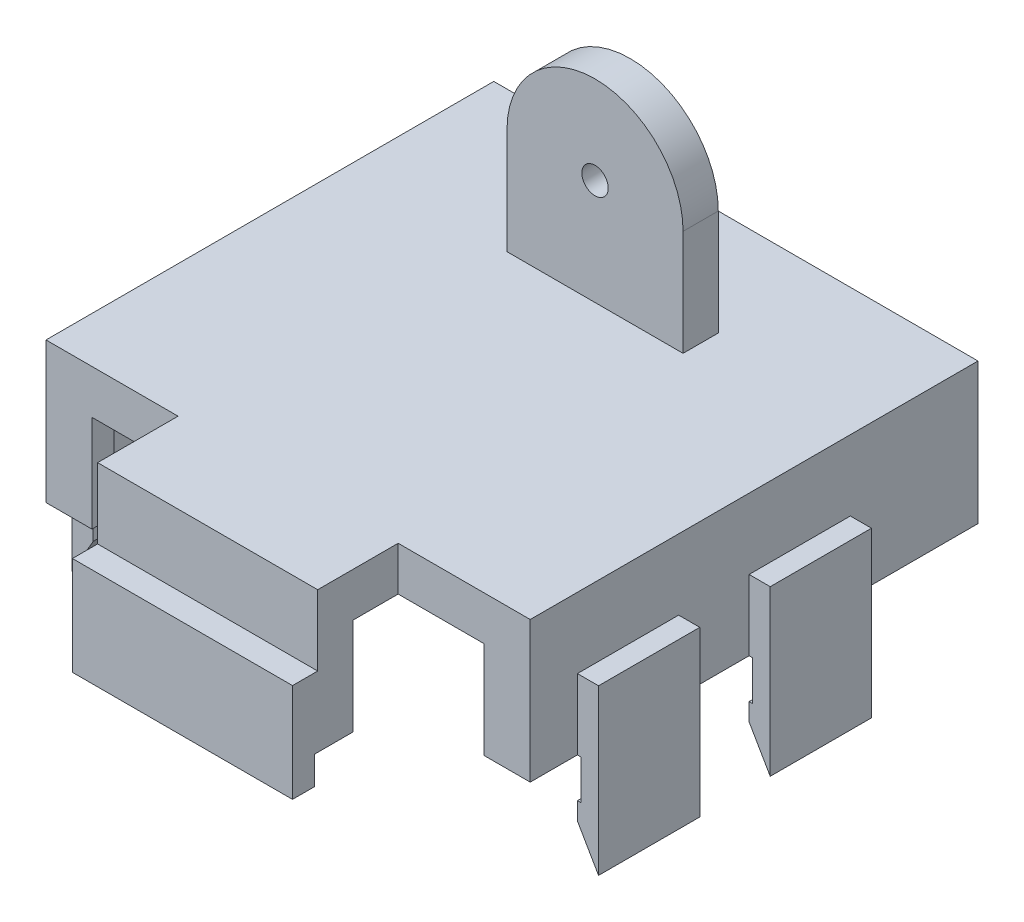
ISO-10303-21;
HEADER;
FILE_DESCRIPTION(('STEP AP214'),'2;1');
FILE_NAME('part.step','',(''),(''),'','','');
FILE_SCHEMA(('AUTOMOTIVE_DESIGN { 1 0 10303 214 1 1 1 1 }'));
ENDSEC;
DATA;
#1=APPLICATION_CONTEXT('core data for automotive mechanical design processes');
#2=APPLICATION_PROTOCOL_DEFINITION('international standard','automotive_design',2000,#1);
#3=PRODUCT_CONTEXT('',#1,'mechanical');
#4=PRODUCT('Part','Part','',(#3));
#5=PRODUCT_RELATED_PRODUCT_CATEGORY('part','',(#4));
#6=PRODUCT_DEFINITION_FORMATION('','',#4);
#7=PRODUCT_DEFINITION_CONTEXT('part definition',#1,'design');
#8=PRODUCT_DEFINITION('design','',#6,#7);
#9=PRODUCT_DEFINITION_SHAPE('','',#8);
#10=(LENGTH_UNIT() NAMED_UNIT(*) SI_UNIT(.MILLI.,.METRE.));
#11=(NAMED_UNIT(*) PLANE_ANGLE_UNIT() SI_UNIT($,.RADIAN.));
#12=(NAMED_UNIT(*) SI_UNIT($,.STERADIAN.) SOLID_ANGLE_UNIT());
#13=UNCERTAINTY_MEASURE_WITH_UNIT(LENGTH_MEASURE(1.E-05),#10,'distance_accuracy_value','');
#14=(GEOMETRIC_REPRESENTATION_CONTEXT(3) GLOBAL_UNCERTAINTY_ASSIGNED_CONTEXT((#13)) GLOBAL_UNIT_ASSIGNED_CONTEXT((#10,
#11,#12)) REPRESENTATION_CONTEXT('',''));
#15=CARTESIAN_POINT('',(0.,0.,0.));
#16=DIRECTION('',(0.,0.,1.));
#17=DIRECTION('',(1.,0.,0.));
#18=AXIS2_PLACEMENT_3D('',#15,#16,#17);
#19=CARTESIAN_POINT('',(0.,-13.5,0.));
#20=DIRECTION('',(0.,1.,0.));
#21=DIRECTION('',(0.,0.,1.));
#22=AXIS2_PLACEMENT_3D('',#19,#20,#21);
#23=PLANE('',#22);
#24=DIRECTION('',(-1.,0.,0.));
#25=VECTOR('',#24,1.);
#26=CARTESIAN_POINT('',(-24.998538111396,-13.5,-14.5974253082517));
#27=LINE('',#26,#25);
#28=CARTESIAN_POINT('',(-53.5058561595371,-13.5,-14.5974253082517));
#29=VERTEX_POINT('',#28);
#30=CARTESIAN_POINT('',(-56.2280683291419,-13.5,-14.5974253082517));
#31=VERTEX_POINT('',#30);
#32=EDGE_CURVE('E480',#29,#31,#27,.T.);
#33=ORIENTED_EDGE('',*,*,#32,.F.);
#34=DIRECTION('',(0.,0.,-1.));
#35=VECTOR('',#34,1.);
#36=CARTESIAN_POINT('',(-53.5058561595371,-13.5,-6.98323493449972));
#37=LINE('',#36,#35);
#38=CARTESIAN_POINT('',(-53.5058561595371,-13.5,-12.0974253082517));
#39=VERTEX_POINT('',#38);
#40=EDGE_CURVE('E466',#39,#29,#37,.T.);
#41=ORIENTED_EDGE('',*,*,#40,.F.);
#42=DIRECTION('',(1.,0.,0.));
#43=VECTOR('',#42,1.);
#44=CARTESIAN_POINT('',(0.,-13.5,-12.0974253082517));
#45=LINE('',#44,#43);
#46=CARTESIAN_POINT('',(-58.7280683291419,-13.5,-12.0974253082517));
#47=VERTEX_POINT('',#46);
#48=EDGE_CURVE('E477',#47,#39,#45,.T.);
#49=ORIENTED_EDGE('',*,*,#48,.F.);
#50=DIRECTION('',(0.,0.,-1.));
#51=VECTOR('',#50,1.);
#52=CARTESIAN_POINT('',(-58.7280683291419,-13.5,0.));
#53=LINE('',#52,#51);
#54=CARTESIAN_POINT('',(-58.7280683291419,-13.5,-17.4577904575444));
#55=VERTEX_POINT('',#54);
#56=EDGE_CURVE('E701',#47,#55,#53,.T.);
#57=ORIENTED_EDGE('',*,*,#56,.T.);
#58=DIRECTION('',(-1.,0.,0.));
#59=VECTOR('',#58,1.);
#60=CARTESIAN_POINT('',(0.,-13.5,-17.4577904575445));
#61=LINE('',#60,#59);
#62=CARTESIAN_POINT('',(-59.1280683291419,-13.5,-17.4577904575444));
#63=VERTEX_POINT('',#62);
#64=EDGE_CURVE('E682',#55,#63,#61,.T.);
#65=ORIENTED_EDGE('',*,*,#64,.T.);
#66=DIRECTION('',(0.,0.,-1.));
#67=VECTOR('',#66,1.);
#68=CARTESIAN_POINT('',(-59.1280683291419,-13.5,15.852864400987));
#69=LINE('',#68,#67);
#70=CARTESIAN_POINT('',(-59.1280683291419,-13.5,-28.9577904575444));
#71=VERTEX_POINT('',#70);
#72=EDGE_CURVE('E774',#63,#71,#69,.T.);
#73=ORIENTED_EDGE('',*,*,#72,.T.);
#74=DIRECTION('',(1.,0.,0.));
#75=VECTOR('',#74,1.);
#76=CARTESIAN_POINT('',(0.,-13.5,-28.9577904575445));
#77=LINE('',#76,#75);
#78=CARTESIAN_POINT('',(-58.7280683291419,-13.5,-28.9577904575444));
#79=VERTEX_POINT('',#78);
#80=EDGE_CURVE('E696',#71,#79,#77,.T.);
#81=ORIENTED_EDGE('',*,*,#80,.T.);
#82=DIRECTION('',(0.,0.,-1.));
#83=VECTOR('',#82,1.);
#84=CARTESIAN_POINT('',(-58.7280683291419,-13.5,0.));
#85=LINE('',#84,#83);
#86=CARTESIAN_POINT('',(-58.7280683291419,-13.5,-36.9577904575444));
#87=VERTEX_POINT('',#86);
#88=EDGE_CURVE('E703',#79,#87,#85,.T.);
#89=ORIENTED_EDGE('',*,*,#88,.T.);
#90=DIRECTION('',(-1.,0.,0.));
#91=VECTOR('',#90,1.);
#92=CARTESIAN_POINT('',(0.,-13.5,-36.9577904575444));
#93=LINE('',#92,#91);
#94=CARTESIAN_POINT('',(-59.1280683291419,-13.5,-36.9577904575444));
#95=VERTEX_POINT('',#94);
#96=EDGE_CURVE('E689',#87,#95,#93,.T.);
#97=ORIENTED_EDGE('',*,*,#96,.T.);
#98=CARTESIAN_POINT('',(-59.1280683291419,-13.5,-48.4577904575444));
#99=VERTEX_POINT('',#98);
#100=EDGE_CURVE('E775',#95,#99,#69,.T.);
#101=ORIENTED_EDGE('',*,*,#100,.T.);
#102=DIRECTION('',(1.,0.,0.));
#103=VECTOR('',#102,1.);
#104=CARTESIAN_POINT('',(0.,-13.5,-48.4577904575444));
#105=LINE('',#104,#103);
#106=CARTESIAN_POINT('',(-58.7280683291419,-13.5,-48.4577904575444));
#107=VERTEX_POINT('',#106);
#108=EDGE_CURVE('E719',#99,#107,#105,.T.);
#109=ORIENTED_EDGE('',*,*,#108,.T.);
#110=DIRECTION('',(0.,0.,-1.));
#111=VECTOR('',#110,1.);
#112=CARTESIAN_POINT('',(-58.7280683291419,-13.5,0.));
#113=LINE('',#112,#111);
#114=CARTESIAN_POINT('',(-58.7280683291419,-13.5,-62.9577904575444));
#115=VERTEX_POINT('',#114);
#116=EDGE_CURVE('E725',#107,#115,#113,.T.);
#117=ORIENTED_EDGE('',*,*,#116,.T.);
#118=DIRECTION('',(1.,0.,0.));
#119=VECTOR('',#118,1.);
#120=CARTESIAN_POINT('',(-3.72806832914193,-13.5,-62.9577904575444));
#121=LINE('',#120,#119);
#122=CARTESIAN_POINT('',(-52.7280683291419,-13.5,-62.9577904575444));
#123=VERTEX_POINT('',#122);
#124=EDGE_CURVE('E822',#115,#123,#121,.T.);
#125=ORIENTED_EDGE('',*,*,#124,.T.);
#126=DIRECTION('',(0.,0.,-1.));
#127=VECTOR('',#126,1.);
#128=CARTESIAN_POINT('',(-52.7280683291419,-13.5,-33.5877327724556));
#129=LINE('',#128,#127);
#130=CARTESIAN_POINT('',(-52.7280683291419,-13.5,-60.4577904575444));
#131=VERTEX_POINT('',#130);
#132=EDGE_CURVE('E787',#123,#131,#129,.F.);
#133=ORIENTED_EDGE('',*,*,#132,.T.);
#134=DIRECTION('',(1.,0.,0.));
#135=VECTOR('',#134,1.);
#136=CARTESIAN_POINT('',(-6.22806832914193,-13.5,-60.4577904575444));
#137=LINE('',#136,#135);
#138=CARTESIAN_POINT('',(-56.2280683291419,-13.5,-60.4577904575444));
#139=VERTEX_POINT('',#138);
#140=EDGE_CURVE('E798',#139,#131,#137,.T.);
#141=ORIENTED_EDGE('',*,*,#140,.F.);
#142=DIRECTION('',(0.,0.,-1.));
#143=VECTOR('',#142,1.);
#144=CARTESIAN_POINT('',(-56.2280683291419,-13.5,-60.4577904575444));
#145=LINE('',#144,#143);
#146=EDGE_CURVE('E794',#31,#139,#145,.T.);
#147=ORIENTED_EDGE('',*,*,#146,.F.);
#148=EDGE_LOOP('',(#33,#41,#49,#57,#65,#73,#81,#89,#97,#101,#109,#117,#125,#133,#141,#147));
#149=FACE_BOUND('',#148,.T.);
#150=ADVANCED_FACE('F37',(#149),#23,.F.);
#151=DIRECTION('',(0.,0.,1.));
#152=VECTOR('',#151,1.);
#153=CARTESIAN_POINT('',(-43.728068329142,-13.5,0.));
#154=LINE('',#153,#152);
#155=CARTESIAN_POINT('',(-43.728068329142,-13.5,-6.98323493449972));
#156=VERTEX_POINT('',#155);
#157=CARTESIAN_POINT('',(-43.728068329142,-13.5,-2.56875580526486));
#158=VERTEX_POINT('',#157);
#159=EDGE_CURVE('E499',#156,#158,#154,.T.);
#160=ORIENTED_EDGE('',*,*,#159,.F.);
#161=DIRECTION('',(-1.,0.,0.));
#162=VECTOR('',#161,1.);
#163=CARTESIAN_POINT('',(-53.5058561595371,-13.5,-6.98323493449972));
#164=LINE('',#163,#162);
#165=CARTESIAN_POINT('',(-41.2280683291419,-13.5,-6.98323493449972));
#166=VERTEX_POINT('',#165);
#167=EDGE_CURVE('E891',#166,#156,#164,.T.);
#168=ORIENTED_EDGE('',*,*,#167,.F.);
#169=DIRECTION('',(0.,0.,1.));
#170=VECTOR('',#169,1.);
#171=CARTESIAN_POINT('',(-41.2280683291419,-13.5,-12.0974253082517));
#172=LINE('',#171,#170);
#173=CARTESIAN_POINT('',(-41.2280683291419,-13.5,-5.45779045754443));
#174=VERTEX_POINT('',#173);
#175=EDGE_CURVE('E941',#166,#174,#172,.T.);
#176=ORIENTED_EDGE('',*,*,#175,.T.);
#177=DIRECTION('',(-1.,0.,0.));
#178=VECTOR('',#177,1.);
#179=CARTESIAN_POINT('',(-56.2280683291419,-13.5,-5.45779045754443));
#180=LINE('',#179,#178);
#181=CARTESIAN_POINT('',(-21.2280683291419,-13.5,-5.45779045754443));
#182=VERTEX_POINT('',#181);
#183=EDGE_CURVE('E805',#182,#174,#180,.T.);
#184=ORIENTED_EDGE('',*,*,#183,.F.);
#185=DIRECTION('',(0.,0.,-1.));
#186=VECTOR('',#185,1.);
#187=CARTESIAN_POINT('',(-21.2280683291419,-13.5,-12.0974253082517));
#188=LINE('',#187,#186);
#189=CARTESIAN_POINT('',(-21.2280683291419,-13.5,-6.98323493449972));
#190=VERTEX_POINT('',#189);
#191=EDGE_CURVE('E926',#182,#190,#188,.T.);
#192=ORIENTED_EDGE('',*,*,#191,.T.);
#193=CARTESIAN_POINT('',(-18.7280683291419,-13.5,-6.98323493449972));
#194=VERTEX_POINT('',#193);
#195=EDGE_CURVE('E893',#194,#190,#164,.T.);
#196=ORIENTED_EDGE('',*,*,#195,.F.);
#197=DIRECTION('',(0.,0.,-1.));
#198=VECTOR('',#197,1.);
#199=CARTESIAN_POINT('',(-18.7280683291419,-13.5,0.));
#200=LINE('',#199,#198);
#201=CARTESIAN_POINT('',(-18.7280683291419,-13.5,-2.56875580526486));
#202=VERTEX_POINT('',#201);
#203=EDGE_CURVE('E520',#202,#194,#200,.T.);
#204=ORIENTED_EDGE('',*,*,#203,.F.);
#205=DIRECTION('',(-1.,0.,0.));
#206=VECTOR('',#205,1.);
#207=CARTESIAN_POINT('',(7.8281912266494,-13.5,-2.56875580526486));
#208=LINE('',#207,#206);
#209=EDGE_CURVE('E564',#202,#158,#208,.T.);
#210=ORIENTED_EDGE('',*,*,#209,.T.);
#211=EDGE_LOOP('',(#160,#168,#176,#184,#192,#196,#204,#210));
#212=FACE_BOUND('',#211,.T.);
#213=ADVANCED_FACE('F1094',(#212),#23,.F.);
#214=CARTESIAN_POINT('',(0.,0.,0.));
#215=DIRECTION('',(0.,1.,0.));
#216=DIRECTION('',(0.,0.,1.));
#217=AXIS2_PLACEMENT_3D('',#214,#215,#216);
#218=PLANE('',#217);
#219=DIRECTION('',(0.,0.,1.));
#220=VECTOR('',#219,1.);
#221=CARTESIAN_POINT('',(-21.2280683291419,0.,-12.0974253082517));
#222=LINE('',#221,#220);
#223=CARTESIAN_POINT('',(-21.2280683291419,0.,-14.5974253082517));
#224=VERTEX_POINT('',#223);
#225=CARTESIAN_POINT('',(-21.2280683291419,0.,-5.45779045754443));
#226=VERTEX_POINT('',#225);
#227=EDGE_CURVE('E925',#224,#226,#222,.T.);
#228=ORIENTED_EDGE('',*,*,#227,.T.);
#229=DIRECTION('',(-1.,0.,0.));
#230=VECTOR('',#229,1.);
#231=CARTESIAN_POINT('',(-56.2280683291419,0.,-5.45779045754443));
#232=LINE('',#231,#230);
#233=CARTESIAN_POINT('',(-41.2280683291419,0.,-5.45779045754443));
#234=VERTEX_POINT('',#233);
#235=EDGE_CURVE('E797',#226,#234,#232,.T.);
#236=ORIENTED_EDGE('',*,*,#235,.T.);
#237=DIRECTION('',(0.,0.,-1.));
#238=VECTOR('',#237,1.);
#239=CARTESIAN_POINT('',(-41.2280683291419,0.,-12.0974253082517));
#240=LINE('',#239,#238);
#241=CARTESIAN_POINT('',(-41.2280683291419,0.,-14.5974253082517));
#242=VERTEX_POINT('',#241);
#243=EDGE_CURVE('E942',#234,#242,#240,.T.);
#244=ORIENTED_EDGE('',*,*,#243,.T.);
#245=DIRECTION('',(-1.,0.,0.));
#246=VECTOR('',#245,1.);
#247=CARTESIAN_POINT('',(-24.998538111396,0.,-14.5974253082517));
#248=LINE('',#247,#246);
#249=CARTESIAN_POINT('',(-56.2280683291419,0.,-14.5974253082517));
#250=VERTEX_POINT('',#249);
#251=EDGE_CURVE('E945',#242,#250,#248,.T.);
#252=ORIENTED_EDGE('',*,*,#251,.T.);
#253=DIRECTION('',(0.,0.,-1.));
#254=VECTOR('',#253,1.);
#255=CARTESIAN_POINT('',(-56.2280683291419,0.,-60.4577904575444));
#256=LINE('',#255,#254);
#257=CARTESIAN_POINT('',(-56.2280683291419,0.,-60.4577904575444));
#258=VERTEX_POINT('',#257);
#259=EDGE_CURVE('E793',#250,#258,#256,.T.);
#260=ORIENTED_EDGE('',*,*,#259,.T.);
#261=DIRECTION('',(1.,0.,0.));
#262=VECTOR('',#261,1.);
#263=CARTESIAN_POINT('',(-6.22806832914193,0.,-60.4577904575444));
#264=LINE('',#263,#262);
#265=CARTESIAN_POINT('',(-6.22806832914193,0.,-60.4577904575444));
#266=VERTEX_POINT('',#265);
#267=EDGE_CURVE('E810',#258,#266,#264,.T.);
#268=ORIENTED_EDGE('',*,*,#267,.T.);
#269=DIRECTION('',(0.,0.,1.));
#270=VECTOR('',#269,1.);
#271=CARTESIAN_POINT('',(-6.22806832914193,0.,-5.45779045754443));
#272=LINE('',#271,#270);
#273=CARTESIAN_POINT('',(-6.22806832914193,0.,-14.5974253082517));
#274=VERTEX_POINT('',#273);
#275=EDGE_CURVE('E813',#266,#274,#272,.T.);
#276=ORIENTED_EDGE('',*,*,#275,.T.);
#277=DIRECTION('',(1.,0.,0.));
#278=VECTOR('',#277,1.);
#279=CARTESIAN_POINT('',(-37.4575985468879,0.,-14.5974253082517));
#280=LINE('',#279,#278);
#281=EDGE_CURVE('E931',#224,#274,#280,.T.);
#282=ORIENTED_EDGE('',*,*,#281,.F.);
#283=EDGE_LOOP('',(#228,#236,#244,#252,#260,#268,#276,#282));
#284=FACE_BOUND('',#283,.T.);
#285=ADVANCED_FACE('F1072',(#284),#218,.F.);
#286=CARTESIAN_POINT('',(-56.2280683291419,-13.5,-5.45779045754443));
#287=DIRECTION('',(0.,0.,-1.));
#288=DIRECTION('',(-1.,0.,0.));
#289=AXIS2_PLACEMENT_3D('',#286,#287,#288);
#290=PLANE('',#289);
#291=ORIENTED_EDGE('',*,*,#235,.F.);
#292=DIRECTION('',(0.,1.,0.));
#293=VECTOR('',#292,1.);
#294=CARTESIAN_POINT('',(-21.2280683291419,0.,-5.45779045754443));
#295=LINE('',#294,#293);
#296=EDGE_CURVE('E471',#182,#226,#295,.T.);
#297=ORIENTED_EDGE('',*,*,#296,.F.);
#298=ORIENTED_EDGE('',*,*,#183,.T.);
#299=DIRECTION('',(0.,-1.,0.));
#300=VECTOR('',#299,1.);
#301=CARTESIAN_POINT('',(-41.2280683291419,0.,-5.45779045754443));
#302=LINE('',#301,#300);
#303=EDGE_CURVE('E928',#234,#174,#302,.T.);
#304=ORIENTED_EDGE('',*,*,#303,.F.);
#305=EDGE_LOOP('',(#291,#297,#298,#304));
#306=FACE_BOUND('',#305,.T.);
#307=ADVANCED_FACE('F1089',(#306),#290,.T.);
#308=CARTESIAN_POINT('',(-3.72806832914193,24.5,-12.0974253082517));
#309=DIRECTION('',(0.,0.,1.));
#310=DIRECTION('',(1.,0.,0.));
#311=AXIS2_PLACEMENT_3D('',#308,#309,#310);
#312=PLANE('',#311);
#313=DIRECTION('',(0.,1.,0.));
#314=VECTOR('',#313,1.);
#315=CARTESIAN_POINT('',(-8.95028049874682,24.5,-12.0974253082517));
#316=LINE('',#315,#314);
#317=CARTESIAN_POINT('',(-8.95028049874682,-13.5,-12.0974253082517));
#318=VERTEX_POINT('',#317);
#319=CARTESIAN_POINT('',(-8.95028049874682,-2.5,-12.0974253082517));
#320=VERTEX_POINT('',#319);
#321=EDGE_CURVE('E472',#318,#320,#316,.T.);
#322=ORIENTED_EDGE('',*,*,#321,.F.);
#323=DIRECTION('',(1.,0.,0.));
#324=VECTOR('',#323,1.);
#325=CARTESIAN_POINT('',(0.,-13.5,-12.0974253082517));
#326=LINE('',#325,#324);
#327=CARTESIAN_POINT('',(-3.72806832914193,-13.5,-12.0974253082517));
#328=VERTEX_POINT('',#327);
#329=EDGE_CURVE('E531',#318,#328,#326,.T.);
#330=ORIENTED_EDGE('',*,*,#329,.T.);
#331=DIRECTION('',(0.,-1.,0.));
#332=VECTOR('',#331,1.);
#333=CARTESIAN_POINT('',(-3.72806832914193,24.5,-12.0974253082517));
#334=LINE('',#333,#332);
#335=CARTESIAN_POINT('',(-3.72806832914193,2.5,-12.0974253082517));
#336=VERTEX_POINT('',#335);
#337=EDGE_CURVE('E514',#336,#328,#334,.T.);
#338=ORIENTED_EDGE('',*,*,#337,.F.);
#339=DIRECTION('',(1.,0.,0.));
#340=VECTOR('',#339,1.);
#341=CARTESIAN_POINT('',(0.,2.5,-12.0974253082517));
#342=LINE('',#341,#340);
#343=CARTESIAN_POINT('',(-18.7280683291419,2.5,-12.0974253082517));
#344=VERTEX_POINT('',#343);
#345=EDGE_CURVE('E533',#344,#336,#342,.T.);
#346=ORIENTED_EDGE('',*,*,#345,.F.);
#347=DIRECTION('',(0.,-1.,0.));
#348=VECTOR('',#347,1.);
#349=CARTESIAN_POINT('',(-18.7280683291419,24.5,-12.0974253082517));
#350=LINE('',#349,#348);
#351=CARTESIAN_POINT('',(-18.7280683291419,-2.5,-12.0974253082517));
#352=VERTEX_POINT('',#351);
#353=EDGE_CURVE('E511',#344,#352,#350,.T.);
#354=ORIENTED_EDGE('',*,*,#353,.T.);
#355=DIRECTION('',(1.,0.,0.));
#356=VECTOR('',#355,1.);
#357=CARTESIAN_POINT('',(-3.72806832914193,-2.5,-12.0974253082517));
#358=LINE('',#357,#356);
#359=EDGE_CURVE('E909',#352,#320,#358,.T.);
#360=ORIENTED_EDGE('',*,*,#359,.T.);
#361=EDGE_LOOP('',(#322,#330,#338,#346,#354,#360));
#362=FACE_BOUND('',#361,.T.);
#363=ADVANCED_FACE('F1114',(#362),#312,.T.);
#364=CARTESIAN_POINT('',(-6.22806832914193,-13.5,-5.45779045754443));
#365=DIRECTION('',(-1.,0.,0.));
#366=DIRECTION('',(0.,0.,1.));
#367=AXIS2_PLACEMENT_3D('',#364,#365,#366);
#368=PLANE('',#367);
#369=DIRECTION('',(0.,0.,1.));
#370=VECTOR('',#369,1.);
#371=CARTESIAN_POINT('',(-6.22806832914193,-13.5,-5.45779045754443));
#372=LINE('',#371,#370);
#373=CARTESIAN_POINT('',(-6.22806832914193,-13.5,-60.4577904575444));
#374=VERTEX_POINT('',#373);
#375=CARTESIAN_POINT('',(-6.22806832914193,-13.5,-14.5974253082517));
#376=VERTEX_POINT('',#375);
#377=EDGE_CURVE('E801',#374,#376,#372,.T.);
#378=ORIENTED_EDGE('',*,*,#377,.T.);
#379=DIRECTION('',(0.,-1.,0.));
#380=VECTOR('',#379,1.);
#381=CARTESIAN_POINT('',(-6.22806832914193,-13.5,-14.5974253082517));
#382=LINE('',#381,#380);
#383=EDGE_CURVE('E922',#274,#376,#382,.T.);
#384=ORIENTED_EDGE('',*,*,#383,.F.);
#385=ORIENTED_EDGE('',*,*,#275,.F.);
#386=DIRECTION('',(0.,1.,0.));
#387=VECTOR('',#386,1.);
#388=CARTESIAN_POINT('',(-6.22806832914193,-13.5,-60.4577904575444));
#389=LINE('',#388,#387);
#390=EDGE_CURVE('E808',#374,#266,#389,.T.);
#391=ORIENTED_EDGE('',*,*,#390,.F.);
#392=EDGE_LOOP('',(#378,#384,#385,#391));
#393=FACE_BOUND('',#392,.T.);
#394=ADVANCED_FACE('F1068',(#393),#368,.T.);
#395=CARTESIAN_POINT('',(-58.7280683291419,24.5,-12.0974253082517));
#396=DIRECTION('',(0.,0.,1.));
#397=DIRECTION('',(1.,0.,0.));
#398=AXIS2_PLACEMENT_3D('',#395,#396,#397);
#399=PLANE('',#398);
#400=DIRECTION('',(0.,-1.,0.));
#401=VECTOR('',#400,1.);
#402=CARTESIAN_POINT('',(-53.5058561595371,24.5,-12.0974253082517));
#403=LINE('',#402,#401);
#404=CARTESIAN_POINT('',(-53.5058561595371,-2.5,-12.0974253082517));
#405=VERTEX_POINT('',#404);
#406=EDGE_CURVE('E463',#405,#39,#403,.T.);
#407=ORIENTED_EDGE('',*,*,#406,.F.);
#408=DIRECTION('',(1.,0.,0.));
#409=VECTOR('',#408,1.);
#410=CARTESIAN_POINT('',(-58.7280683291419,-2.5,-12.0974253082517));
#411=LINE('',#410,#409);
#412=CARTESIAN_POINT('',(-43.728068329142,-2.5,-12.0974253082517));
#413=VERTEX_POINT('',#412);
#414=EDGE_CURVE('E904',#405,#413,#411,.T.);
#415=ORIENTED_EDGE('',*,*,#414,.T.);
#416=DIRECTION('',(0.,-1.,0.));
#417=VECTOR('',#416,1.);
#418=CARTESIAN_POINT('',(-43.728068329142,24.5,-12.0974253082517));
#419=LINE('',#418,#417);
#420=CARTESIAN_POINT('',(-43.728068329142,2.5,-12.0974253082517));
#421=VERTEX_POINT('',#420);
#422=EDGE_CURVE('E493',#421,#413,#419,.T.);
#423=ORIENTED_EDGE('',*,*,#422,.F.);
#424=DIRECTION('',(1.,0.,0.));
#425=VECTOR('',#424,1.);
#426=CARTESIAN_POINT('',(0.,2.5,-12.0974253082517));
#427=LINE('',#426,#425);
#428=CARTESIAN_POINT('',(-58.7280683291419,2.5,-12.0974253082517));
#429=VERTEX_POINT('',#428);
#430=EDGE_CURVE('E486',#429,#421,#427,.T.);
#431=ORIENTED_EDGE('',*,*,#430,.F.);
#432=DIRECTION('',(0.,-1.,0.));
#433=VECTOR('',#432,1.);
#434=CARTESIAN_POINT('',(-58.7280683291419,24.5,-12.0974253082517));
#435=LINE('',#434,#433);
#436=EDGE_CURVE('E485',#429,#47,#435,.T.);
#437=ORIENTED_EDGE('',*,*,#436,.T.);
#438=ORIENTED_EDGE('',*,*,#48,.T.);
#439=EDGE_LOOP('',(#407,#415,#423,#431,#437,#438));
#440=FACE_BOUND('',#439,.T.);
#441=ADVANCED_FACE('F483',(#440),#399,.T.);
#442=CARTESIAN_POINT('',(-56.2280683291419,-13.5,-60.4577904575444));
#443=DIRECTION('',(1.,0.,0.));
#444=DIRECTION('',(0.,0.,-1.));
#445=AXIS2_PLACEMENT_3D('',#442,#443,#444);
#446=PLANE('',#445);
#447=ORIENTED_EDGE('',*,*,#259,.F.);
#448=DIRECTION('',(0.,1.,0.));
#449=VECTOR('',#448,1.);
#450=CARTESIAN_POINT('',(-56.2280683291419,-13.5,-14.5974253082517));
#451=LINE('',#450,#449);
#452=EDGE_CURVE('E937',#31,#250,#451,.T.);
#453=ORIENTED_EDGE('',*,*,#452,.F.);
#454=ORIENTED_EDGE('',*,*,#146,.T.);
#455=DIRECTION('',(0.,1.,0.));
#456=VECTOR('',#455,1.);
#457=CARTESIAN_POINT('',(-56.2280683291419,-13.5,-60.4577904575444));
#458=LINE('',#457,#456);
#459=EDGE_CURVE('E818',#139,#258,#458,.T.);
#460=ORIENTED_EDGE('',*,*,#459,.T.);
#461=EDGE_LOOP('',(#447,#453,#454,#460));
#462=FACE_BOUND('',#461,.T.);
#463=ADVANCED_FACE('F1077',(#462),#446,.T.);
#464=CARTESIAN_POINT('',(-58.7280683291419,2.5,-2.95779045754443));
#465=DIRECTION('',(0.,0.,-1.));
#466=DIRECTION('',(-1.,0.,0.));
#467=AXIS2_PLACEMENT_3D('',#464,#465,#466);
#468=PLANE('',#467);
#469=DIRECTION('',(0.,1.,0.));
#470=VECTOR('',#469,1.);
#471=CARTESIAN_POINT('',(-43.728068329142,2.5,-2.95779045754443));
#472=LINE('',#471,#470);
#473=CARTESIAN_POINT('',(-43.728068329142,-5.5,-2.95779045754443));
#474=VERTEX_POINT('',#473);
#475=CARTESIAN_POINT('',(-43.728068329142,2.5,-2.95779045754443));
#476=VERTEX_POINT('',#475);
#477=EDGE_CURVE('E504',#474,#476,#472,.T.);
#478=ORIENTED_EDGE('',*,*,#477,.F.);
#479=DIRECTION('',(-1.,0.,0.));
#480=VECTOR('',#479,1.);
#481=CARTESIAN_POINT('',(7.8281912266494,-5.5,-2.95779045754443));
#482=LINE('',#481,#480);
#483=CARTESIAN_POINT('',(-18.7280683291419,-5.5,-2.95779045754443));
#484=VERTEX_POINT('',#483);
#485=EDGE_CURVE('E573',#484,#474,#482,.T.);
#486=ORIENTED_EDGE('',*,*,#485,.F.);
#487=DIRECTION('',(0.,-1.,0.));
#488=VECTOR('',#487,1.);
#489=CARTESIAN_POINT('',(-18.7280683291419,2.5,-2.95779045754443));
#490=LINE('',#489,#488);
#491=CARTESIAN_POINT('',(-18.7280683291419,2.5,-2.95779045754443));
#492=VERTEX_POINT('',#491);
#493=EDGE_CURVE('E526',#492,#484,#490,.T.);
#494=ORIENTED_EDGE('',*,*,#493,.F.);
#495=DIRECTION('',(1.,0.,0.));
#496=VECTOR('',#495,1.);
#497=CARTESIAN_POINT('',(-58.7280683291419,2.5,-2.95779045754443));
#498=LINE('',#497,#496);
#499=EDGE_CURVE('E828',#476,#492,#498,.T.);
#500=ORIENTED_EDGE('',*,*,#499,.F.);
#501=EDGE_LOOP('',(#478,#486,#494,#500));
#502=FACE_BOUND('',#501,.T.);
#503=ADVANCED_FACE('F1123',(#502),#468,.F.);
#504=CARTESIAN_POINT('',(0.,2.5,0.));
#505=DIRECTION('',(0.,1.,0.));
#506=DIRECTION('',(0.,0.,1.));
#507=AXIS2_PLACEMENT_3D('',#504,#505,#506);
#508=PLANE('',#507);
#509=DIRECTION('',(0.,0.,-1.));
#510=VECTOR('',#509,1.);
#511=CARTESIAN_POINT('',(-41.2280683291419,2.5,-46.9577904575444));
#512=LINE('',#511,#510);
#513=CARTESIAN_POINT('',(-41.2280683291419,2.5,-46.9577904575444));
#514=VERTEX_POINT('',#513);
#515=CARTESIAN_POINT('',(-41.2280683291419,2.5,-50.9577904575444));
#516=VERTEX_POINT('',#515);
#517=EDGE_CURVE('E561',#514,#516,#512,.T.);
#518=ORIENTED_EDGE('',*,*,#517,.T.);
#519=DIRECTION('',(1.,0.,0.));
#520=VECTOR('',#519,1.);
#521=CARTESIAN_POINT('',(-61.1280683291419,2.50000000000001,-50.9577904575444));
#522=LINE('',#521,#520);
#523=CARTESIAN_POINT('',(-21.2280683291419,2.5,-50.9577904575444));
#524=VERTEX_POINT('',#523);
#525=EDGE_CURVE('E539',#516,#524,#522,.T.);
#526=ORIENTED_EDGE('',*,*,#525,.T.);
#527=DIRECTION('',(0.,0.,-1.));
#528=VECTOR('',#527,1.);
#529=CARTESIAN_POINT('',(-21.2280683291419,2.5,-46.9577904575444));
#530=LINE('',#529,#528);
#531=CARTESIAN_POINT('',(-21.2280683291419,2.5,-46.9577904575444));
#532=VERTEX_POINT('',#531);
#533=EDGE_CURVE('E565',#532,#524,#530,.T.);
#534=ORIENTED_EDGE('',*,*,#533,.F.);
#535=DIRECTION('',(-1.,0.,0.));
#536=VECTOR('',#535,1.);
#537=CARTESIAN_POINT('',(-41.2280683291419,2.5,-46.9577904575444));
#538=LINE('',#537,#536);
#539=EDGE_CURVE('E557',#532,#514,#538,.T.);
#540=ORIENTED_EDGE('',*,*,#539,.T.);
#541=EDGE_LOOP('',(#518,#526,#534,#540));
#542=FACE_BOUND('',#541,.T.);
#543=ORIENTED_EDGE('',*,*,#430,.T.);
#544=DIRECTION('',(0.,0.,1.));
#545=VECTOR('',#544,1.);
#546=CARTESIAN_POINT('',(-43.728068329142,2.5,0.));
#547=LINE('',#546,#545);
#548=EDGE_CURVE('E506',#421,#476,#547,.T.);
#549=ORIENTED_EDGE('',*,*,#548,.T.);
#550=ORIENTED_EDGE('',*,*,#499,.T.);
#551=DIRECTION('',(0.,0.,-1.));
#552=VECTOR('',#551,1.);
#553=CARTESIAN_POINT('',(-18.7280683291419,2.5,0.));
#554=LINE('',#553,#552);
#555=EDGE_CURVE('E528',#492,#344,#554,.T.);
#556=ORIENTED_EDGE('',*,*,#555,.T.);
#557=ORIENTED_EDGE('',*,*,#345,.T.);
#558=DIRECTION('',(0.,0.,-1.));
#559=VECTOR('',#558,1.);
#560=CARTESIAN_POINT('',(-3.72806832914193,2.5,-62.9577904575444));
#561=LINE('',#560,#559);
#562=CARTESIAN_POINT('',(-3.72806832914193,2.5,-62.9577904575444));
#563=VERTEX_POINT('',#562);
#564=EDGE_CURVE('E830',#336,#563,#561,.T.);
#565=ORIENTED_EDGE('',*,*,#564,.T.);
#566=DIRECTION('',(-1.,0.,0.));
#567=VECTOR('',#566,1.);
#568=CARTESIAN_POINT('',(-58.7280683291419,2.5,-62.9577904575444));
#569=LINE('',#568,#567);
#570=CARTESIAN_POINT('',(-58.7280683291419,2.5,-62.9577904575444));
#571=VERTEX_POINT('',#570);
#572=EDGE_CURVE('E832',#563,#571,#569,.T.);
#573=ORIENTED_EDGE('',*,*,#572,.T.);
#574=DIRECTION('',(0.,0.,1.));
#575=VECTOR('',#574,1.);
#576=CARTESIAN_POINT('',(-58.7280683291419,2.5,-62.9577904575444));
#577=LINE('',#576,#575);
#578=EDGE_CURVE('E824',#571,#429,#577,.T.);
#579=ORIENTED_EDGE('',*,*,#578,.T.);
#580=EDGE_LOOP('',(#543,#549,#550,#556,#557,#565,#573,#579));
#581=FACE_BOUND('',#580,.T.);
#582=ADVANCED_FACE('F957',(#542,#581),#508,.T.);
#583=CARTESIAN_POINT('',(7.8281912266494,-5.5,-2.95779045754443));
#584=DIRECTION('',(0.,1.,0.));
#585=DIRECTION('',(0.,0.,1.));
#586=AXIS2_PLACEMENT_3D('',#583,#584,#585);
#587=PLANE('',#586);
#588=ORIENTED_EDGE('',*,*,#485,.T.);
#589=DIRECTION('',(0.,0.,1.));
#590=VECTOR('',#589,1.);
#591=CARTESIAN_POINT('',(-43.728068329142,-5.5,-2.95779045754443));
#592=LINE('',#591,#590);
#593=CARTESIAN_POINT('',(-43.728068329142,-5.5,-0.0974253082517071));
#594=VERTEX_POINT('',#593);
#595=EDGE_CURVE('E501',#474,#594,#592,.T.);
#596=ORIENTED_EDGE('',*,*,#595,.T.);
#597=DIRECTION('',(-1.,0.,0.));
#598=VECTOR('',#597,1.);
#599=CARTESIAN_POINT('',(7.8281912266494,-5.5,-0.0974253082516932));
#600=LINE('',#599,#598);
#601=CARTESIAN_POINT('',(-18.7280683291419,-5.5,-0.0974253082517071));
#602=VERTEX_POINT('',#601);
#603=EDGE_CURVE('E577',#602,#594,#600,.T.);
#604=ORIENTED_EDGE('',*,*,#603,.F.);
#605=DIRECTION('',(0.,0.,-1.));
#606=VECTOR('',#605,1.);
#607=CARTESIAN_POINT('',(-18.7280683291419,-5.5,-2.95779045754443));
#608=LINE('',#607,#606);
#609=EDGE_CURVE('E523',#602,#484,#608,.T.);
#610=ORIENTED_EDGE('',*,*,#609,.T.);
#611=EDGE_LOOP('',(#588,#596,#604,#610));
#612=FACE_BOUND('',#611,.T.);
#613=ADVANCED_FACE('F1128',(#612),#587,.T.);
#614=CARTESIAN_POINT('',(7.8281912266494,-5.5,-0.0974253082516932));
#615=DIRECTION('',(0.,0.,1.));
#616=DIRECTION('',(1.,0.,0.));
#617=AXIS2_PLACEMENT_3D('',#614,#615,#616);
#618=PLANE('',#617);
#619=ORIENTED_EDGE('',*,*,#603,.T.);
#620=DIRECTION('',(0.,-1.,0.));
#621=VECTOR('',#620,1.);
#622=CARTESIAN_POINT('',(-43.728068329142,24.5,-0.0974253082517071));
#623=LINE('',#622,#621);
#624=CARTESIAN_POINT('',(-43.728068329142,-16.6966712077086,-0.0974253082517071));
#625=VERTEX_POINT('',#624);
#626=EDGE_CURVE('E487',#594,#625,#623,.T.);
#627=ORIENTED_EDGE('',*,*,#626,.T.);
#628=DIRECTION('',(-1.,0.,0.));
#629=VECTOR('',#628,1.);
#630=CARTESIAN_POINT('',(7.8281912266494,-16.6966712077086,-0.0974253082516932));
#631=LINE('',#630,#629);
#632=CARTESIAN_POINT('',(-18.7280683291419,-16.6966712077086,-0.0974253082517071));
#633=VERTEX_POINT('',#632);
#634=EDGE_CURVE('E580',#633,#625,#631,.T.);
#635=ORIENTED_EDGE('',*,*,#634,.F.);
#636=DIRECTION('',(0.,-1.,0.));
#637=VECTOR('',#636,1.);
#638=CARTESIAN_POINT('',(-18.7280683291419,24.5,-0.0974253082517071));
#639=LINE('',#638,#637);
#640=EDGE_CURVE('E509',#602,#633,#639,.T.);
#641=ORIENTED_EDGE('',*,*,#640,.F.);
#642=EDGE_LOOP('',(#619,#627,#635,#641));
#643=FACE_BOUND('',#642,.T.);
#644=ADVANCED_FACE('F1130',(#643),#618,.T.);
#645=CARTESIAN_POINT('',(7.8281912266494,-16.6966712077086,-2.56875580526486));
#646=DIRECTION('',(0.,-1.,0.));
#647=DIRECTION('',(0.,0.,-1.));
#648=AXIS2_PLACEMENT_3D('',#645,#646,#647);
#649=PLANE('',#648);
#650=ORIENTED_EDGE('',*,*,#634,.T.);
#651=DIRECTION('',(0.,0.,-1.));
#652=VECTOR('',#651,1.);
#653=CARTESIAN_POINT('',(-43.728068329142,-16.6966712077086,-2.56875580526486));
#654=LINE('',#653,#652);
#655=CARTESIAN_POINT('',(-43.728068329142,-16.6966712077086,-2.56875580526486));
#656=VERTEX_POINT('',#655);
#657=EDGE_CURVE('E490',#625,#656,#654,.T.);
#658=ORIENTED_EDGE('',*,*,#657,.T.);
#659=DIRECTION('',(-1.,0.,0.));
#660=VECTOR('',#659,1.);
#661=CARTESIAN_POINT('',(7.8281912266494,-16.6966712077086,-2.56875580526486));
#662=LINE('',#661,#660);
#663=CARTESIAN_POINT('',(-18.7280683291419,-16.6966712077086,-2.56875580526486));
#664=VERTEX_POINT('',#663);
#665=EDGE_CURVE('E583',#664,#656,#662,.T.);
#666=ORIENTED_EDGE('',*,*,#665,.F.);
#667=DIRECTION('',(0.,0.,1.));
#668=VECTOR('',#667,1.);
#669=CARTESIAN_POINT('',(-18.7280683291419,-16.6966712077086,-2.56875580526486));
#670=LINE('',#669,#668);
#671=EDGE_CURVE('E517',#664,#633,#670,.T.);
#672=ORIENTED_EDGE('',*,*,#671,.T.);
#673=EDGE_LOOP('',(#650,#658,#666,#672));
#674=FACE_BOUND('',#673,.T.);
#675=ADVANCED_FACE('F1134',(#674),#649,.T.);
#676=CARTESIAN_POINT('',(7.8281912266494,-13.5,-2.56875580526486));
#677=DIRECTION('',(0.,0.,-1.));
#678=DIRECTION('',(-1.,0.,0.));
#679=AXIS2_PLACEMENT_3D('',#676,#677,#678);
#680=PLANE('',#679);
#681=ORIENTED_EDGE('',*,*,#665,.T.);
#682=DIRECTION('',(0.,1.,0.));
#683=VECTOR('',#682,1.);
#684=CARTESIAN_POINT('',(-43.728068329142,-13.5,-2.56875580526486));
#685=LINE('',#684,#683);
#686=EDGE_CURVE('E864',#656,#158,#685,.T.);
#687=ORIENTED_EDGE('',*,*,#686,.T.);
#688=ORIENTED_EDGE('',*,*,#209,.F.);
#689=DIRECTION('',(0.,-1.,0.));
#690=VECTOR('',#689,1.);
#691=CARTESIAN_POINT('',(-18.7280683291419,-13.5,-2.56875580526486));
#692=LINE('',#691,#690);
#693=EDGE_CURVE('E859',#202,#664,#692,.T.);
#694=ORIENTED_EDGE('',*,*,#693,.T.);
#695=EDGE_LOOP('',(#681,#687,#688,#694));
#696=FACE_BOUND('',#695,.T.);
#697=ADVANCED_FACE('F1136',(#696),#680,.T.);
#698=CARTESIAN_POINT('',(-58.7280683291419,2.5,-62.9577904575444));
#699=DIRECTION('',(1.,0.,0.));
#700=DIRECTION('',(0.,0.,-1.));
#701=AXIS2_PLACEMENT_3D('',#698,#699,#700);
#702=PLANE('',#701);
#703=ORIENTED_EDGE('',*,*,#436,.F.);
#704=ORIENTED_EDGE('',*,*,#578,.F.);
#705=DIRECTION('',(0.,-1.,0.));
#706=VECTOR('',#705,1.);
#707=CARTESIAN_POINT('',(-58.7280683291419,2.5,-62.9577904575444));
#708=LINE('',#707,#706);
#709=EDGE_CURVE('E834',#571,#115,#708,.T.);
#710=ORIENTED_EDGE('',*,*,#709,.T.);
#711=ORIENTED_EDGE('',*,*,#116,.F.);
#712=DIRECTION('',(0.,1.,0.));
#713=VECTOR('',#712,1.);
#714=CARTESIAN_POINT('',(-58.7280683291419,-24.1569219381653,-48.4577904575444));
#715=LINE('',#714,#713);
#716=CARTESIAN_POINT('',(-58.7280683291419,-5.50000000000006,-48.4577904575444));
#717=VERTEX_POINT('',#716);
#718=EDGE_CURVE('E710',#107,#717,#715,.T.);
#719=ORIENTED_EDGE('',*,*,#718,.T.);
#720=DIRECTION('',(0.,0.,-1.));
#721=VECTOR('',#720,1.);
#722=CARTESIAN_POINT('',(-58.7280683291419,-5.5,15.852864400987));
#723=LINE('',#722,#721);
#724=CARTESIAN_POINT('',(-58.7280683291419,-5.50000000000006,-36.9577904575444));
#725=VERTEX_POINT('',#724);
#726=EDGE_CURVE('E756',#725,#717,#723,.T.);
#727=ORIENTED_EDGE('',*,*,#726,.F.);
#728=DIRECTION('',(0.,1.,0.));
#729=VECTOR('',#728,1.);
#730=CARTESIAN_POINT('',(-58.7280683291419,-24.1569219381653,-36.9577904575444));
#731=LINE('',#730,#729);
#732=EDGE_CURVE('E594',#87,#725,#731,.T.);
#733=ORIENTED_EDGE('',*,*,#732,.F.);
#734=ORIENTED_EDGE('',*,*,#88,.F.);
#735=DIRECTION('',(0.,1.,0.));
#736=VECTOR('',#735,1.);
#737=CARTESIAN_POINT('',(-58.7280683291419,-24.1569219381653,-28.9577904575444));
#738=LINE('',#737,#736);
#739=CARTESIAN_POINT('',(-58.7280683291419,-5.50000000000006,-28.9577904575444));
#740=VERTEX_POINT('',#739);
#741=EDGE_CURVE('E595',#79,#740,#738,.T.);
#742=ORIENTED_EDGE('',*,*,#741,.T.);
#743=CARTESIAN_POINT('',(-58.7280683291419,-5.50000000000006,-17.4577904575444));
#744=VERTEX_POINT('',#743);
#745=EDGE_CURVE('E758',#744,#740,#723,.T.);
#746=ORIENTED_EDGE('',*,*,#745,.F.);
#747=DIRECTION('',(0.,1.,0.));
#748=VECTOR('',#747,1.);
#749=CARTESIAN_POINT('',(-58.7280683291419,-24.1569219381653,-17.4577904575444));
#750=LINE('',#749,#748);
#751=EDGE_CURVE('E607',#55,#744,#750,.T.);
#752=ORIENTED_EDGE('',*,*,#751,.F.);
#753=ORIENTED_EDGE('',*,*,#56,.F.);
#754=EDGE_LOOP('',(#703,#704,#710,#711,#719,#727,#733,#734,#742,#746,#752,#753));
#755=FACE_BOUND('',#754,.T.);
#756=ADVANCED_FACE('F39',(#755),#702,.F.);
#757=ORIENTED_EDGE('',*,*,#329,.F.);
#758=DIRECTION('',(0.,0.,1.));
#759=VECTOR('',#758,1.);
#760=CARTESIAN_POINT('',(-8.95028049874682,-13.5,-6.98323493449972));
#761=LINE('',#760,#759);
#762=CARTESIAN_POINT('',(-8.95028049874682,-13.5,-14.5974253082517));
#763=VERTEX_POINT('',#762);
#764=EDGE_CURVE('E481',#763,#318,#761,.T.);
#765=ORIENTED_EDGE('',*,*,#764,.F.);
#766=DIRECTION('',(1.,0.,0.));
#767=VECTOR('',#766,1.);
#768=CARTESIAN_POINT('',(-37.4575985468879,-13.5,-14.5974253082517));
#769=LINE('',#768,#767);
#770=EDGE_CURVE('E879',#763,#376,#769,.T.);
#771=ORIENTED_EDGE('',*,*,#770,.T.);
#772=ORIENTED_EDGE('',*,*,#377,.F.);
#773=CARTESIAN_POINT('',(-8.22806832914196,-13.5,-60.4577904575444));
#774=VERTEX_POINT('',#773);
#775=EDGE_CURVE('E796',#774,#374,#137,.T.);
#776=ORIENTED_EDGE('',*,*,#775,.F.);
#777=DIRECTION('',(0.,0.,-1.));
#778=VECTOR('',#777,1.);
#779=CARTESIAN_POINT('',(-8.22806832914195,-13.5,-33.5877327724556));
#780=LINE('',#779,#778);
#781=CARTESIAN_POINT('',(-8.22806832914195,-13.5,-62.9577904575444));
#782=VERTEX_POINT('',#781);
#783=EDGE_CURVE('E782',#774,#782,#780,.T.);
#784=ORIENTED_EDGE('',*,*,#783,.T.);
#785=CARTESIAN_POINT('',(-3.72806832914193,-13.5,-62.9577904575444));
#786=VERTEX_POINT('',#785);
#787=EDGE_CURVE('E821',#782,#786,#121,.T.);
#788=ORIENTED_EDGE('',*,*,#787,.T.);
#789=DIRECTION('',(0.,0.,1.));
#790=VECTOR('',#789,1.);
#791=CARTESIAN_POINT('',(-3.72806832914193,-13.5,0.));
#792=LINE('',#791,#790);
#793=CARTESIAN_POINT('',(-3.72806832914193,-13.5,-48.4577904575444));
#794=VERTEX_POINT('',#793);
#795=EDGE_CURVE('E643',#786,#794,#792,.T.);
#796=ORIENTED_EDGE('',*,*,#795,.T.);
#797=DIRECTION('',(1.,0.,0.));
#798=VECTOR('',#797,1.);
#799=CARTESIAN_POINT('',(0.,-13.5,-48.4577904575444));
#800=LINE('',#799,#798);
#801=CARTESIAN_POINT('',(-3.32806832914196,-13.5,-48.4577904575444));
#802=VERTEX_POINT('',#801);
#803=EDGE_CURVE('E648',#794,#802,#800,.T.);
#804=ORIENTED_EDGE('',*,*,#803,.T.);
#805=DIRECTION('',(0.,0.,-1.));
#806=VECTOR('',#805,1.);
#807=CARTESIAN_POINT('',(-3.32806832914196,-13.5,15.852864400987));
#808=LINE('',#807,#806);
#809=CARTESIAN_POINT('',(-3.32806832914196,-13.5,-36.9577904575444));
#810=VERTEX_POINT('',#809);
#811=EDGE_CURVE('E746',#810,#802,#808,.T.);
#812=ORIENTED_EDGE('',*,*,#811,.F.);
#813=DIRECTION('',(-1.,0.,0.));
#814=VECTOR('',#813,1.);
#815=CARTESIAN_POINT('',(0.,-13.5,-36.9577904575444));
#816=LINE('',#815,#814);
#817=CARTESIAN_POINT('',(-3.72806832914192,-13.5,-36.9577904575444));
#818=VERTEX_POINT('',#817);
#819=EDGE_CURVE('E665',#810,#818,#816,.T.);
#820=ORIENTED_EDGE('',*,*,#819,.T.);
#821=DIRECTION('',(0.,0.,1.));
#822=VECTOR('',#821,1.);
#823=CARTESIAN_POINT('',(-3.72806832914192,-13.5,0.));
#824=LINE('',#823,#822);
#825=CARTESIAN_POINT('',(-3.72806832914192,-13.5,-28.9577904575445));
#826=VERTEX_POINT('',#825);
#827=EDGE_CURVE('E653',#818,#826,#824,.T.);
#828=ORIENTED_EDGE('',*,*,#827,.T.);
#829=DIRECTION('',(1.,0.,0.));
#830=VECTOR('',#829,1.);
#831=CARTESIAN_POINT('',(0.,-13.5,-28.9577904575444));
#832=LINE('',#831,#830);
#833=CARTESIAN_POINT('',(-3.32806832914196,-13.5,-28.9577904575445));
#834=VERTEX_POINT('',#833);
#835=EDGE_CURVE('E658',#826,#834,#832,.T.);
#836=ORIENTED_EDGE('',*,*,#835,.T.);
#837=CARTESIAN_POINT('',(-3.32806832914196,-13.5,-17.4577904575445));
#838=VERTEX_POINT('',#837);
#839=EDGE_CURVE('E745',#838,#834,#808,.T.);
#840=ORIENTED_EDGE('',*,*,#839,.F.);
#841=DIRECTION('',(-1.,0.,0.));
#842=VECTOR('',#841,1.);
#843=CARTESIAN_POINT('',(0.,-13.5,-17.4577904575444));
#844=LINE('',#843,#842);
#845=CARTESIAN_POINT('',(-3.72806832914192,-13.5,-17.4577904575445));
#846=VERTEX_POINT('',#845);
#847=EDGE_CURVE('E675',#838,#846,#844,.T.);
#848=ORIENTED_EDGE('',*,*,#847,.T.);
#849=DIRECTION('',(0.,0.,1.));
#850=VECTOR('',#849,1.);
#851=CARTESIAN_POINT('',(-3.72806832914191,-13.5,0.));
#852=LINE('',#851,#850);
#853=EDGE_CURVE('E670',#846,#328,#852,.T.);
#854=ORIENTED_EDGE('',*,*,#853,.T.);
#855=EDGE_LOOP('',(#757,#765,#771,#772,#776,#784,#788,#796,#804,#812,#820,#828,#836,#840,#848,#854));
#856=FACE_BOUND('',#855,.T.);
#857=ADVANCED_FACE('F889',(#856),#23,.F.);
#858=CARTESIAN_POINT('',(-3.72806832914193,2.5,-62.9577904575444));
#859=DIRECTION('',(-1.,0.,0.));
#860=DIRECTION('',(0.,0.,1.));
#861=AXIS2_PLACEMENT_3D('',#858,#859,#860);
#862=PLANE('',#861);
#863=ORIENTED_EDGE('',*,*,#337,.T.);
#864=ORIENTED_EDGE('',*,*,#853,.F.);
#865=DIRECTION('',(0.,1.,0.));
#866=VECTOR('',#865,1.);
#867=CARTESIAN_POINT('',(-3.72806832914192,-24.1569219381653,-17.4577904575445));
#868=LINE('',#867,#866);
#869=CARTESIAN_POINT('',(-3.72806832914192,-5.50000000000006,-17.4577904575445));
#870=VERTEX_POINT('',#869);
#871=EDGE_CURVE('E616',#846,#870,#868,.T.);
#872=ORIENTED_EDGE('',*,*,#871,.T.);
#873=DIRECTION('',(0.,0.,-1.));
#874=VECTOR('',#873,1.);
#875=CARTESIAN_POINT('',(-3.72806832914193,-5.50000000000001,15.852864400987));
#876=LINE('',#875,#874);
#877=CARTESIAN_POINT('',(-3.72806832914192,-5.50000000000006,-28.9577904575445));
#878=VERTEX_POINT('',#877);
#879=EDGE_CURVE('E741',#870,#878,#876,.T.);
#880=ORIENTED_EDGE('',*,*,#879,.T.);
#881=DIRECTION('',(0.,1.,0.));
#882=VECTOR('',#881,1.);
#883=CARTESIAN_POINT('',(-3.72806832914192,-24.1569219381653,-28.9577904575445));
#884=LINE('',#883,#882);
#885=EDGE_CURVE('E633',#826,#878,#884,.T.);
#886=ORIENTED_EDGE('',*,*,#885,.F.);
#887=ORIENTED_EDGE('',*,*,#827,.F.);
#888=DIRECTION('',(0.,1.,0.));
#889=VECTOR('',#888,1.);
#890=CARTESIAN_POINT('',(-3.72806832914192,-24.1569219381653,-36.9577904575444));
#891=LINE('',#890,#889);
#892=CARTESIAN_POINT('',(-3.72806832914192,-5.50000000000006,-36.9577904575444));
#893=VERTEX_POINT('',#892);
#894=EDGE_CURVE('E627',#818,#893,#891,.T.);
#895=ORIENTED_EDGE('',*,*,#894,.T.);
#896=CARTESIAN_POINT('',(-3.72806832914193,-5.50000000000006,-48.4577904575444));
#897=VERTEX_POINT('',#896);
#898=EDGE_CURVE('E742',#893,#897,#876,.T.);
#899=ORIENTED_EDGE('',*,*,#898,.T.);
#900=DIRECTION('',(0.,1.,0.));
#901=VECTOR('',#900,1.);
#902=CARTESIAN_POINT('',(-3.72806832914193,-24.1569219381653,-48.4577904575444));
#903=LINE('',#902,#901);
#904=EDGE_CURVE('E638',#794,#897,#903,.T.);
#905=ORIENTED_EDGE('',*,*,#904,.F.);
#906=ORIENTED_EDGE('',*,*,#795,.F.);
#907=DIRECTION('',(0.,-1.,0.));
#908=VECTOR('',#907,1.);
#909=CARTESIAN_POINT('',(-3.72806832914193,2.5,-62.9577904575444));
#910=LINE('',#909,#908);
#911=EDGE_CURVE('E836',#563,#786,#910,.T.);
#912=ORIENTED_EDGE('',*,*,#911,.F.);
#913=ORIENTED_EDGE('',*,*,#564,.F.);
#914=EDGE_LOOP('',(#863,#864,#872,#880,#886,#887,#895,#899,#905,#906,#912,#913));
#915=FACE_BOUND('',#914,.T.);
#916=ADVANCED_FACE('F1162',(#915),#862,.F.);
#917=CARTESIAN_POINT('',(-58.7280683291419,-5.5,15.852864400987));
#918=DIRECTION('',(0.,1.,0.));
#919=DIRECTION('',(-1.,0.,0.));
#920=AXIS2_PLACEMENT_3D('',#917,#918,#919);
#921=PLANE('',#920);
#922=DIRECTION('',(1.,0.,0.));
#923=VECTOR('',#922,1.);
#924=CARTESIAN_POINT('',(-58.7280683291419,-5.50000000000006,-28.9577904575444));
#925=LINE('',#924,#923);
#926=CARTESIAN_POINT('',(-61.1280683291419,-5.50000000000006,-28.9577904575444));
#927=VERTEX_POINT('',#926);
#928=EDGE_CURVE('E590',#927,#740,#925,.T.);
#929=ORIENTED_EDGE('',*,*,#928,.F.);
#930=DIRECTION('',(0.,0.,-1.));
#931=VECTOR('',#930,1.);
#932=CARTESIAN_POINT('',(-61.1280683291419,-5.5,15.852864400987));
#933=LINE('',#932,#931);
#934=CARTESIAN_POINT('',(-61.1280683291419,-5.50000000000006,-17.4577904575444));
#935=VERTEX_POINT('',#934);
#936=EDGE_CURVE('E759',#935,#927,#933,.T.);
#937=ORIENTED_EDGE('',*,*,#936,.F.);
#938=DIRECTION('',(-1.,0.,0.));
#939=VECTOR('',#938,1.);
#940=CARTESIAN_POINT('',(-58.7280683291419,-5.50000000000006,-17.4577904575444));
#941=LINE('',#940,#939);
#942=EDGE_CURVE('E605',#744,#935,#941,.T.);
#943=ORIENTED_EDGE('',*,*,#942,.F.);
#944=ORIENTED_EDGE('',*,*,#745,.T.);
#945=EDGE_LOOP('',(#929,#937,#943,#944));
#946=FACE_BOUND('',#945,.T.);
#947=ADVANCED_FACE('F1004',(#946),#921,.T.);
#948=CARTESIAN_POINT('',(-61.1280683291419,-5.5,15.852864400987));
#949=DIRECTION('',(-1.,0.,0.));
#950=DIRECTION('',(0.,0.,1.));
#951=AXIS2_PLACEMENT_3D('',#948,#949,#950);
#952=PLANE('',#951);
#953=DIRECTION('',(0.,1.,0.));
#954=VECTOR('',#953,1.);
#955=CARTESIAN_POINT('',(-61.1280683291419,-24.1569219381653,-28.9577904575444));
#956=LINE('',#955,#954);
#957=CARTESIAN_POINT('',(-61.1280683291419,-24.1569219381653,-28.9577904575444));
#958=VERTEX_POINT('',#957);
#959=EDGE_CURVE('E598',#958,#927,#956,.T.);
#960=ORIENTED_EDGE('',*,*,#959,.F.);
#961=DIRECTION('',(0.,0.,-1.));
#962=VECTOR('',#961,1.);
#963=CARTESIAN_POINT('',(-61.1280683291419,-24.1569219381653,15.852864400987));
#964=LINE('',#963,#962);
#965=CARTESIAN_POINT('',(-61.1280683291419,-24.1569219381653,-17.4577904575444));
#966=VERTEX_POINT('',#965);
#967=EDGE_CURVE('E762',#966,#958,#964,.T.);
#968=ORIENTED_EDGE('',*,*,#967,.F.);
#969=DIRECTION('',(0.,1.,0.));
#970=VECTOR('',#969,1.);
#971=CARTESIAN_POINT('',(-61.1280683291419,-24.1569219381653,-17.4577904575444));
#972=LINE('',#971,#970);
#973=EDGE_CURVE('E591',#966,#935,#972,.T.);
#974=ORIENTED_EDGE('',*,*,#973,.T.);
#975=ORIENTED_EDGE('',*,*,#936,.T.);
#976=EDGE_LOOP('',(#960,#968,#974,#975));
#977=FACE_BOUND('',#976,.T.);
#978=ADVANCED_FACE('F1001',(#977),#952,.T.);
#979=CARTESIAN_POINT('',(-58.7280683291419,-20.,15.852864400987));
#980=DIRECTION('',(0.866025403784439,-0.5,0.));
#981=DIRECTION('',(0.5,0.866025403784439,0.));
#982=AXIS2_PLACEMENT_3D('',#979,#980,#981);
#983=PLANE('',#982);
#984=DIRECTION('',(-0.5,-0.866025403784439,0.));
#985=VECTOR('',#984,1.);
#986=CARTESIAN_POINT('',(-58.728068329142,-20.,-28.9577904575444));
#987=LINE('',#986,#985);
#988=CARTESIAN_POINT('',(-58.7280683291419,-20.,-28.9577904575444));
#989=VERTEX_POINT('',#988);
#990=EDGE_CURVE('E699',#989,#958,#987,.T.);
#991=ORIENTED_EDGE('',*,*,#990,.F.);
#992=DIRECTION('',(0.,0.,-1.));
#993=VECTOR('',#992,1.);
#994=CARTESIAN_POINT('',(-58.7280683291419,-20.,15.852864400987));
#995=LINE('',#994,#993);
#996=CARTESIAN_POINT('',(-58.7280683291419,-20.,-17.4577904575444));
#997=VERTEX_POINT('',#996);
#998=EDGE_CURVE('E765',#997,#989,#995,.T.);
#999=ORIENTED_EDGE('',*,*,#998,.F.);
#1000=DIRECTION('',(0.5,0.866025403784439,0.));
#1001=VECTOR('',#1000,1.);
#1002=CARTESIAN_POINT('',(-58.728068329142,-20.,-17.4577904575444));
#1003=LINE('',#1002,#1001);
#1004=EDGE_CURVE('E685',#966,#997,#1003,.T.);
#1005=ORIENTED_EDGE('',*,*,#1004,.F.);
#1006=ORIENTED_EDGE('',*,*,#967,.T.);
#1007=EDGE_LOOP('',(#991,#999,#1005,#1006));
#1008=FACE_BOUND('',#1007,.T.);
#1009=ADVANCED_FACE('F994',(#1008),#983,.T.);
#1010=CARTESIAN_POINT('',(-58.7280683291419,-18.,15.852864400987));
#1011=DIRECTION('',(1.,0.,0.));
#1012=DIRECTION('',(0.,1.,0.));
#1013=AXIS2_PLACEMENT_3D('',#1010,#1011,#1012);
#1014=PLANE('',#1013);
#1015=CARTESIAN_POINT('',(-58.7280683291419,-18.,-28.9577904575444));
#1016=VERTEX_POINT('',#1015);
#1017=EDGE_CURVE('E597',#989,#1016,#738,.T.);
#1018=ORIENTED_EDGE('',*,*,#1017,.T.);
#1019=DIRECTION('',(0.,0.,-1.));
#1020=VECTOR('',#1019,1.);
#1021=CARTESIAN_POINT('',(-58.7280683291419,-18.,15.852864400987));
#1022=LINE('',#1021,#1020);
#1023=CARTESIAN_POINT('',(-58.7280683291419,-18.,-17.4577904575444));
#1024=VERTEX_POINT('',#1023);
#1025=EDGE_CURVE('E768',#1024,#1016,#1022,.T.);
#1026=ORIENTED_EDGE('',*,*,#1025,.F.);
#1027=EDGE_CURVE('E611',#997,#1024,#750,.T.);
#1028=ORIENTED_EDGE('',*,*,#1027,.F.);
#1029=ORIENTED_EDGE('',*,*,#998,.T.);
#1030=EDGE_LOOP('',(#1018,#1026,#1028,#1029));
#1031=FACE_BOUND('',#1030,.T.);
#1032=ADVANCED_FACE('F989',(#1031),#1014,.T.);
#1033=CARTESIAN_POINT('',(-58.7280683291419,-18.,15.852864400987));
#1034=DIRECTION('',(0.,1.,0.));
#1035=DIRECTION('',(0.,0.,1.));
#1036=AXIS2_PLACEMENT_3D('',#1033,#1034,#1035);
#1037=PLANE('',#1036);
#1038=DIRECTION('',(1.,0.,0.));
#1039=VECTOR('',#1038,1.);
#1040=CARTESIAN_POINT('',(-58.728068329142,-18.,-28.9577904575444));
#1041=LINE('',#1040,#1039);
#1042=CARTESIAN_POINT('',(-59.1280683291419,-18.,-28.9577904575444));
#1043=VERTEX_POINT('',#1042);
#1044=EDGE_CURVE('E694',#1043,#1016,#1041,.T.);
#1045=ORIENTED_EDGE('',*,*,#1044,.F.);
#1046=DIRECTION('',(0.,0.,-1.));
#1047=VECTOR('',#1046,1.);
#1048=CARTESIAN_POINT('',(-59.1280683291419,-18.,15.852864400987));
#1049=LINE('',#1048,#1047);
#1050=CARTESIAN_POINT('',(-59.1280683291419,-18.,-17.4577904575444));
#1051=VERTEX_POINT('',#1050);
#1052=EDGE_CURVE('E771',#1051,#1043,#1049,.T.);
#1053=ORIENTED_EDGE('',*,*,#1052,.F.);
#1054=DIRECTION('',(-1.,0.,0.));
#1055=VECTOR('',#1054,1.);
#1056=CARTESIAN_POINT('',(-58.728068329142,-18.,-17.4577904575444));
#1057=LINE('',#1056,#1055);
#1058=EDGE_CURVE('E680',#1024,#1051,#1057,.T.);
#1059=ORIENTED_EDGE('',*,*,#1058,.F.);
#1060=ORIENTED_EDGE('',*,*,#1025,.T.);
#1061=EDGE_LOOP('',(#1045,#1053,#1059,#1060));
#1062=FACE_BOUND('',#1061,.T.);
#1063=ADVANCED_FACE('F980',(#1062),#1037,.T.);
#1064=CARTESIAN_POINT('',(-59.1280683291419,-18.,15.852864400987));
#1065=DIRECTION('',(1.,0.,0.));
#1066=DIRECTION('',(0.,0.,-1.));
#1067=AXIS2_PLACEMENT_3D('',#1064,#1065,#1066);
#1068=PLANE('',#1067);
#1069=DIRECTION('',(0.,-1.,0.));
#1070=VECTOR('',#1069,1.);
#1071=CARTESIAN_POINT('',(-59.1280683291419,-18.,-28.9577904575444));
#1072=LINE('',#1071,#1070);
#1073=EDGE_CURVE('E857',#71,#1043,#1072,.T.);
#1074=ORIENTED_EDGE('',*,*,#1073,.F.);
#1075=ORIENTED_EDGE('',*,*,#72,.F.);
#1076=DIRECTION('',(0.,1.,0.));
#1077=VECTOR('',#1076,1.);
#1078=CARTESIAN_POINT('',(-59.1280683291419,-18.,-17.4577904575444));
#1079=LINE('',#1078,#1077);
#1080=EDGE_CURVE('E853',#1051,#63,#1079,.T.);
#1081=ORIENTED_EDGE('',*,*,#1080,.F.);
#1082=ORIENTED_EDGE('',*,*,#1052,.T.);
#1083=EDGE_LOOP('',(#1074,#1075,#1081,#1082));
#1084=FACE_BOUND('',#1083,.T.);
#1085=ADVANCED_FACE('F977',(#1084),#1068,.T.);
#1086=CARTESIAN_POINT('',(-3.72806832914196,-18.,15.852864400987));
#1087=DIRECTION('',(-1.,0.,0.));
#1088=DIRECTION('',(0.,-1.,0.));
#1089=AXIS2_PLACEMENT_3D('',#1086,#1087,#1088);
#1090=PLANE('',#1089);
#1091=CARTESIAN_POINT('',(-3.72806832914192,-20.,-36.9577904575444));
#1092=VERTEX_POINT('',#1091);
#1093=CARTESIAN_POINT('',(-3.72806832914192,-18.,-36.9577904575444));
#1094=VERTEX_POINT('',#1093);
#1095=EDGE_CURVE('E635',#1092,#1094,#891,.T.);
#1096=ORIENTED_EDGE('',*,*,#1095,.T.);
#1097=DIRECTION('',(0.,0.,-1.));
#1098=VECTOR('',#1097,1.);
#1099=CARTESIAN_POINT('',(-3.72806832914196,-18.,15.852864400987));
#1100=LINE('',#1099,#1098);
#1101=CARTESIAN_POINT('',(-3.72806832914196,-18.,-48.4577904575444));
#1102=VERTEX_POINT('',#1101);
#1103=EDGE_CURVE('E728',#1094,#1102,#1100,.T.);
#1104=ORIENTED_EDGE('',*,*,#1103,.T.);
#1105=CARTESIAN_POINT('',(-3.72806832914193,-20.,-48.4577904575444));
#1106=VERTEX_POINT('',#1105);
#1107=EDGE_CURVE('E641',#1106,#1102,#903,.T.);
#1108=ORIENTED_EDGE('',*,*,#1107,.F.);
#1109=DIRECTION('',(0.,0.,-1.));
#1110=VECTOR('',#1109,1.);
#1111=CARTESIAN_POINT('',(-3.72806832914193,-20.,15.852864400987));
#1112=LINE('',#1111,#1110);
#1113=EDGE_CURVE('E729',#1092,#1106,#1112,.T.);
#1114=ORIENTED_EDGE('',*,*,#1113,.F.);
#1115=EDGE_LOOP('',(#1096,#1104,#1108,#1114));
#1116=FACE_BOUND('',#1115,.T.);
#1117=ADVANCED_FACE('F1210',(#1116),#1090,.T.);
#1118=CARTESIAN_POINT('',(-3.72806832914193,-20.,15.852864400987));
#1119=DIRECTION('',(-0.866025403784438,-0.500000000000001,0.));
#1120=DIRECTION('',(0.500000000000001,-0.866025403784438,0.));
#1121=AXIS2_PLACEMENT_3D('',#1118,#1119,#1120);
#1122=PLANE('',#1121);
#1123=DIRECTION('',(0.500000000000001,-0.866025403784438,0.));
#1124=VECTOR('',#1123,1.);
#1125=CARTESIAN_POINT('',(-3.72806832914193,-20.,-36.9577904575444));
#1126=LINE('',#1125,#1124);
#1127=CARTESIAN_POINT('',(-1.32806832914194,-24.1569219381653,-36.9577904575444));
#1128=VERTEX_POINT('',#1127);
#1129=EDGE_CURVE('E668',#1092,#1128,#1126,.T.);
#1130=ORIENTED_EDGE('',*,*,#1129,.F.);
#1131=ORIENTED_EDGE('',*,*,#1113,.T.);
#1132=DIRECTION('',(-0.500000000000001,0.866025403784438,0.));
#1133=VECTOR('',#1132,1.);
#1134=CARTESIAN_POINT('',(-3.72806832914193,-20.,-48.4577904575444));
#1135=LINE('',#1134,#1133);
#1136=CARTESIAN_POINT('',(-1.32806832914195,-24.1569219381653,-48.4577904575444));
#1137=VERTEX_POINT('',#1136);
#1138=EDGE_CURVE('E651',#1137,#1106,#1135,.T.);
#1139=ORIENTED_EDGE('',*,*,#1138,.F.);
#1140=DIRECTION('',(0.,0.,-1.));
#1141=VECTOR('',#1140,1.);
#1142=CARTESIAN_POINT('',(-1.32806832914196,-24.1569219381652,15.852864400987));
#1143=LINE('',#1142,#1141);
#1144=EDGE_CURVE('E734',#1128,#1137,#1143,.T.);
#1145=ORIENTED_EDGE('',*,*,#1144,.F.);
#1146=EDGE_LOOP('',(#1130,#1131,#1139,#1145));
#1147=FACE_BOUND('',#1146,.T.);
#1148=ADVANCED_FACE('F1233',(#1147),#1122,.T.);
#1149=CARTESIAN_POINT('',(-1.32806832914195,-5.50000000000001,15.852864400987));
#1150=DIRECTION('',(1.,0.,0.));
#1151=DIRECTION('',(0.,1.,0.));
#1152=AXIS2_PLACEMENT_3D('',#1149,#1150,#1151);
#1153=PLANE('',#1152);
#1154=DIRECTION('',(0.,1.,0.));
#1155=VECTOR('',#1154,1.);
#1156=CARTESIAN_POINT('',(-1.32806832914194,-24.1569219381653,-36.9577904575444));
#1157=LINE('',#1156,#1155);
#1158=CARTESIAN_POINT('',(-1.32806832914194,-5.50000000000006,-36.9577904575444));
#1159=VERTEX_POINT('',#1158);
#1160=EDGE_CURVE('E617',#1128,#1159,#1157,.T.);
#1161=ORIENTED_EDGE('',*,*,#1160,.F.);
#1162=ORIENTED_EDGE('',*,*,#1144,.T.);
#1163=DIRECTION('',(0.,1.,0.));
#1164=VECTOR('',#1163,1.);
#1165=CARTESIAN_POINT('',(-1.32806832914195,-24.1569219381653,-48.4577904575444));
#1166=LINE('',#1165,#1164);
#1167=CARTESIAN_POINT('',(-1.32806832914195,-5.50000000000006,-48.4577904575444));
#1168=VERTEX_POINT('',#1167);
#1169=EDGE_CURVE('E625',#1137,#1168,#1166,.T.);
#1170=ORIENTED_EDGE('',*,*,#1169,.T.);
#1171=DIRECTION('',(0.,0.,-1.));
#1172=VECTOR('',#1171,1.);
#1173=CARTESIAN_POINT('',(-1.32806832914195,-5.50000000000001,15.852864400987));
#1174=LINE('',#1173,#1172);
#1175=EDGE_CURVE('E738',#1159,#1168,#1174,.T.);
#1176=ORIENTED_EDGE('',*,*,#1175,.F.);
#1177=EDGE_LOOP('',(#1161,#1162,#1170,#1176));
#1178=FACE_BOUND('',#1177,.T.);
#1179=ADVANCED_FACE('F1229',(#1178),#1153,.T.);
#1180=CARTESIAN_POINT('',(-3.72806832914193,-5.50000000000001,15.852864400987));
#1181=DIRECTION('',(0.,1.,0.));
#1182=DIRECTION('',(0.,0.,1.));
#1183=AXIS2_PLACEMENT_3D('',#1180,#1181,#1182);
#1184=PLANE('',#1183);
#1185=DIRECTION('',(-1.,0.,0.));
#1186=VECTOR('',#1185,1.);
#1187=CARTESIAN_POINT('',(-3.72806832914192,-5.50000000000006,-36.9577904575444));
#1188=LINE('',#1187,#1186);
#1189=EDGE_CURVE('E621',#1159,#893,#1188,.T.);
#1190=ORIENTED_EDGE('',*,*,#1189,.F.);
#1191=ORIENTED_EDGE('',*,*,#1175,.T.);
#1192=DIRECTION('',(1.,0.,0.));
#1193=VECTOR('',#1192,1.);
#1194=CARTESIAN_POINT('',(-3.72806832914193,-5.50000000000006,-48.4577904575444));
#1195=LINE('',#1194,#1193);
#1196=EDGE_CURVE('E576',#897,#1168,#1195,.T.);
#1197=ORIENTED_EDGE('',*,*,#1196,.F.);
#1198=ORIENTED_EDGE('',*,*,#898,.F.);
#1199=EDGE_LOOP('',(#1190,#1191,#1197,#1198));
#1200=FACE_BOUND('',#1199,.T.);
#1201=ADVANCED_FACE('F1225',(#1200),#1184,.T.);
#1202=CARTESIAN_POINT('',(-3.32806832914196,-18.,15.852864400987));
#1203=DIRECTION('',(-1.,0.,0.));
#1204=DIRECTION('',(0.,0.,1.));
#1205=AXIS2_PLACEMENT_3D('',#1202,#1203,#1204);
#1206=PLANE('',#1205);
#1207=DIRECTION('',(0.,-1.,0.));
#1208=VECTOR('',#1207,1.);
#1209=CARTESIAN_POINT('',(-3.32806832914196,-18.,-36.9577904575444));
#1210=LINE('',#1209,#1208);
#1211=CARTESIAN_POINT('',(-3.32806832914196,-18.,-36.9577904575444));
#1212=VERTEX_POINT('',#1211);
#1213=EDGE_CURVE('E663',#810,#1212,#1210,.T.);
#1214=ORIENTED_EDGE('',*,*,#1213,.F.);
#1215=ORIENTED_EDGE('',*,*,#811,.T.);
#1216=DIRECTION('',(0.,1.,0.));
#1217=VECTOR('',#1216,1.);
#1218=CARTESIAN_POINT('',(-3.32806832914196,-18.,-48.4577904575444));
#1219=LINE('',#1218,#1217);
#1220=CARTESIAN_POINT('',(-3.32806832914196,-18.,-48.4577904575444));
#1221=VERTEX_POINT('',#1220);
#1222=EDGE_CURVE('E646',#1221,#802,#1219,.T.);
#1223=ORIENTED_EDGE('',*,*,#1222,.F.);
#1224=DIRECTION('',(0.,0.,-1.));
#1225=VECTOR('',#1224,1.);
#1226=CARTESIAN_POINT('',(-3.32806832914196,-18.,15.852864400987));
#1227=LINE('',#1226,#1225);
#1228=EDGE_CURVE('E750',#1212,#1221,#1227,.T.);
#1229=ORIENTED_EDGE('',*,*,#1228,.F.);
#1230=EDGE_LOOP('',(#1214,#1215,#1223,#1229));
#1231=FACE_BOUND('',#1230,.T.);
#1232=ADVANCED_FACE('F1220',(#1231),#1206,.T.);
#1233=CARTESIAN_POINT('',(-3.72806832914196,-18.,15.852864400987));
#1234=DIRECTION('',(0.,1.,0.));
#1235=DIRECTION('',(0.,0.,1.));
#1236=AXIS2_PLACEMENT_3D('',#1233,#1234,#1235);
#1237=PLANE('',#1236);
#1238=DIRECTION('',(-1.,0.,0.));
#1239=VECTOR('',#1238,1.);
#1240=CARTESIAN_POINT('',(-3.72806832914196,-18.,-36.9577904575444));
#1241=LINE('',#1240,#1239);
#1242=EDGE_CURVE('E849',#1212,#1094,#1241,.T.);
#1243=ORIENTED_EDGE('',*,*,#1242,.F.);
#1244=ORIENTED_EDGE('',*,*,#1228,.T.);
#1245=DIRECTION('',(1.,0.,0.));
#1246=VECTOR('',#1245,1.);
#1247=CARTESIAN_POINT('',(-3.72806832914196,-18.,-48.4577904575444));
#1248=LINE('',#1247,#1246);
#1249=EDGE_CURVE('E845',#1102,#1221,#1248,.T.);
#1250=ORIENTED_EDGE('',*,*,#1249,.F.);
#1251=ORIENTED_EDGE('',*,*,#1103,.F.);
#1252=EDGE_LOOP('',(#1243,#1244,#1250,#1251));
#1253=FACE_BOUND('',#1252,.T.);
#1254=ADVANCED_FACE('F1159',(#1253),#1237,.T.);
#1255=CARTESIAN_POINT('',(-58.7280683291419,2.5,-62.9577904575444));
#1256=DIRECTION('',(0.,0.,1.));
#1257=DIRECTION('',(1.,0.,0.));
#1258=AXIS2_PLACEMENT_3D('',#1255,#1256,#1257);
#1259=PLANE('',#1258);
#1260=ORIENTED_EDGE('',*,*,#709,.F.);
#1261=ORIENTED_EDGE('',*,*,#572,.F.);
#1262=ORIENTED_EDGE('',*,*,#911,.T.);
#1263=ORIENTED_EDGE('',*,*,#787,.F.);
#1264=CARTESIAN_POINT('',(-17.728068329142,-13.5,-62.9577904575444));
#1265=DIRECTION('',(0.,0.,-1.));
#1266=DIRECTION('',(-1.,0.,0.));
#1267=AXIS2_PLACEMENT_3D('',#1264,#1265,#1266);
#1268=CIRCLE('',#1267,9.5);
#1269=CARTESIAN_POINT('',(-27.228068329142,-13.5,-62.9577904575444));
#1270=VERTEX_POINT('',#1269);
#1271=EDGE_CURVE('E777',#1270,#782,#1268,.T.);
#1272=ORIENTED_EDGE('',*,*,#1271,.F.);
#1273=CARTESIAN_POINT('',(-33.728068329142,-13.5,-62.9577904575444));
#1274=VERTEX_POINT('',#1273);
#1275=EDGE_CURVE('E825',#1274,#1270,#121,.T.);
#1276=ORIENTED_EDGE('',*,*,#1275,.F.);
#1277=CARTESIAN_POINT('',(-43.2280683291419,-13.5,-62.9577904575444));
#1278=DIRECTION('',(0.,0.,-1.));
#1279=DIRECTION('',(-1.,0.,0.));
#1280=AXIS2_PLACEMENT_3D('',#1277,#1278,#1279);
#1281=CIRCLE('',#1280,9.5);
#1282=EDGE_CURVE('E785',#123,#1274,#1281,.T.);
#1283=ORIENTED_EDGE('',*,*,#1282,.F.);
#1284=ORIENTED_EDGE('',*,*,#124,.F.);
#1285=EDGE_LOOP('',(#1260,#1261,#1262,#1263,#1272,#1276,#1283,#1284));
#1286=FACE_BOUND('',#1285,.T.);
#1287=ADVANCED_FACE('F1049',(#1286),#1259,.F.);
#1288=ORIENTED_EDGE('',*,*,#1275,.T.);
#1289=DIRECTION('',(0.,0.,-1.));
#1290=VECTOR('',#1289,1.);
#1291=CARTESIAN_POINT('',(-27.228068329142,-13.5,-33.5877327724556));
#1292=LINE('',#1291,#1290);
#1293=CARTESIAN_POINT('',(-27.228068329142,-13.5,-60.4577904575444));
#1294=VERTEX_POINT('',#1293);
#1295=EDGE_CURVE('E779',#1270,#1294,#1292,.F.);
#1296=ORIENTED_EDGE('',*,*,#1295,.T.);
#1297=CARTESIAN_POINT('',(-33.728068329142,-13.5,-60.4577904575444));
#1298=VERTEX_POINT('',#1297);
#1299=EDGE_CURVE('E802',#1298,#1294,#137,.T.);
#1300=ORIENTED_EDGE('',*,*,#1299,.F.);
#1301=DIRECTION('',(0.,0.,-1.));
#1302=VECTOR('',#1301,1.);
#1303=CARTESIAN_POINT('',(-33.728068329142,-13.5,-33.5877327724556));
#1304=LINE('',#1303,#1302);
#1305=EDGE_CURVE('E790',#1298,#1274,#1304,.T.);
#1306=ORIENTED_EDGE('',*,*,#1305,.T.);
#1307=EDGE_LOOP('',(#1288,#1296,#1300,#1306));
#1308=FACE_BOUND('',#1307,.T.);
#1309=ADVANCED_FACE('F1058',(#1308),#23,.F.);
#1310=CARTESIAN_POINT('',(-6.22806832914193,-13.5,-60.4577904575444));
#1311=DIRECTION('',(0.,0.,1.));
#1312=DIRECTION('',(1.,0.,0.));
#1313=AXIS2_PLACEMENT_3D('',#1310,#1311,#1312);
#1314=PLANE('',#1313);
#1315=CARTESIAN_POINT('',(-17.728068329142,-13.5,-60.4577904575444));
#1316=DIRECTION('',(0.,0.,1.));
#1317=DIRECTION('',(1.,0.,0.));
#1318=AXIS2_PLACEMENT_3D('',#1315,#1316,#1317);
#1319=CIRCLE('',#1318,9.5);
#1320=EDGE_CURVE('E840',#774,#1294,#1319,.T.);
#1321=ORIENTED_EDGE('',*,*,#1320,.F.);
#1322=ORIENTED_EDGE('',*,*,#775,.T.);
#1323=ORIENTED_EDGE('',*,*,#390,.T.);
#1324=ORIENTED_EDGE('',*,*,#267,.F.);
#1325=ORIENTED_EDGE('',*,*,#459,.F.);
#1326=ORIENTED_EDGE('',*,*,#140,.T.);
#1327=CARTESIAN_POINT('',(-43.2280683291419,-13.5,-60.4577904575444));
#1328=DIRECTION('',(0.,0.,1.));
#1329=DIRECTION('',(1.,0.,0.));
#1330=AXIS2_PLACEMENT_3D('',#1327,#1328,#1329);
#1331=CIRCLE('',#1330,9.5);
#1332=EDGE_CURVE('E838',#1298,#131,#1331,.T.);
#1333=ORIENTED_EDGE('',*,*,#1332,.F.);
#1334=ORIENTED_EDGE('',*,*,#1299,.T.);
#1335=EDGE_LOOP('',(#1321,#1322,#1323,#1324,#1325,#1326,#1333,#1334));
#1336=FACE_BOUND('',#1335,.T.);
#1337=ADVANCED_FACE('F1064',(#1336),#1314,.T.);
#1338=CARTESIAN_POINT('',(-43.2280683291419,-13.5,-33.5877327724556));
#1339=DIRECTION('',(0.,0.,-1.));
#1340=DIRECTION('',(-1.,0.,0.));
#1341=AXIS2_PLACEMENT_3D('',#1338,#1339,#1340);
#1342=CYLINDRICAL_SURFACE('',#1341,9.5);
#1343=ORIENTED_EDGE('',*,*,#1332,.T.);
#1344=ORIENTED_EDGE('',*,*,#132,.F.);
#1345=ORIENTED_EDGE('',*,*,#1282,.T.);
#1346=ORIENTED_EDGE('',*,*,#1305,.F.);
#1347=EDGE_LOOP('',(#1343,#1344,#1345,#1346));
#1348=FACE_BOUND('',#1347,.T.);
#1349=ADVANCED_FACE('F1054',(#1348),#1342,.F.);
#1350=CARTESIAN_POINT('',(-17.728068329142,-13.5,-33.5877327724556));
#1351=DIRECTION('',(0.,0.,-1.));
#1352=DIRECTION('',(-1.,0.,0.));
#1353=AXIS2_PLACEMENT_3D('',#1350,#1351,#1352);
#1354=CYLINDRICAL_SURFACE('',#1353,9.5);
#1355=ORIENTED_EDGE('',*,*,#1320,.T.);
#1356=ORIENTED_EDGE('',*,*,#1295,.F.);
#1357=ORIENTED_EDGE('',*,*,#1271,.T.);
#1358=ORIENTED_EDGE('',*,*,#783,.F.);
#1359=EDGE_LOOP('',(#1355,#1356,#1357,#1358));
#1360=FACE_BOUND('',#1359,.T.);
#1361=ADVANCED_FACE('F1190',(#1360),#1354,.F.);
#1362=DIRECTION('',(-1.,0.,0.));
#1363=VECTOR('',#1362,1.);
#1364=CARTESIAN_POINT('',(-58.7280683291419,-5.50000000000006,-36.9577904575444));
#1365=LINE('',#1364,#1363);
#1366=CARTESIAN_POINT('',(-61.1280683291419,-5.50000000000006,-36.9577904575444));
#1367=VERTEX_POINT('',#1366);
#1368=EDGE_CURVE('E588',#725,#1367,#1365,.T.);
#1369=ORIENTED_EDGE('',*,*,#1368,.F.);
#1370=ORIENTED_EDGE('',*,*,#726,.T.);
#1371=DIRECTION('',(1.,0.,0.));
#1372=VECTOR('',#1371,1.);
#1373=CARTESIAN_POINT('',(-58.7280683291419,-5.50000000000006,-48.4577904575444));
#1374=LINE('',#1373,#1372);
#1375=CARTESIAN_POINT('',(-61.1280683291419,-5.50000000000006,-48.4577904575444));
#1376=VERTEX_POINT('',#1375);
#1377=EDGE_CURVE('E706',#1376,#717,#1374,.T.);
#1378=ORIENTED_EDGE('',*,*,#1377,.F.);
#1379=EDGE_CURVE('E760',#1367,#1376,#933,.T.);
#1380=ORIENTED_EDGE('',*,*,#1379,.F.);
#1381=EDGE_LOOP('',(#1369,#1370,#1378,#1380));
#1382=FACE_BOUND('',#1381,.T.);
#1383=ADVANCED_FACE('F1015',(#1382),#921,.T.);
#1384=DIRECTION('',(0.,1.,0.));
#1385=VECTOR('',#1384,1.);
#1386=CARTESIAN_POINT('',(-61.1280683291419,-24.1569219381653,-36.9577904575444));
#1387=LINE('',#1386,#1385);
#1388=CARTESIAN_POINT('',(-61.1280683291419,-24.1569219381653,-36.9577904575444));
#1389=VERTEX_POINT('',#1388);
#1390=EDGE_CURVE('E600',#1389,#1367,#1387,.T.);
#1391=ORIENTED_EDGE('',*,*,#1390,.T.);
#1392=ORIENTED_EDGE('',*,*,#1379,.T.);
#1393=DIRECTION('',(0.,1.,0.));
#1394=VECTOR('',#1393,1.);
#1395=CARTESIAN_POINT('',(-61.1280683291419,-24.1569219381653,-48.4577904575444));
#1396=LINE('',#1395,#1394);
#1397=CARTESIAN_POINT('',(-61.1280683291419,-24.1569219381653,-48.4577904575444));
#1398=VERTEX_POINT('',#1397);
#1399=EDGE_CURVE('E709',#1398,#1376,#1396,.T.);
#1400=ORIENTED_EDGE('',*,*,#1399,.F.);
#1401=EDGE_CURVE('E763',#1389,#1398,#964,.T.);
#1402=ORIENTED_EDGE('',*,*,#1401,.F.);
#1403=EDGE_LOOP('',(#1391,#1392,#1400,#1402));
#1404=FACE_BOUND('',#1403,.T.);
#1405=ADVANCED_FACE('F1019',(#1404),#952,.T.);
#1406=DIRECTION('',(0.5,0.866025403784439,0.));
#1407=VECTOR('',#1406,1.);
#1408=CARTESIAN_POINT('',(-58.7280683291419,-20.,-36.9577904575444));
#1409=LINE('',#1408,#1407);
#1410=CARTESIAN_POINT('',(-58.7280683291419,-20.,-36.9577904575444));
#1411=VERTEX_POINT('',#1410);
#1412=EDGE_CURVE('E692',#1389,#1411,#1409,.T.);
#1413=ORIENTED_EDGE('',*,*,#1412,.F.);
#1414=ORIENTED_EDGE('',*,*,#1401,.T.);
#1415=DIRECTION('',(-0.5,-0.866025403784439,0.));
#1416=VECTOR('',#1415,1.);
#1417=CARTESIAN_POINT('',(-58.7280683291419,-20.,-48.4577904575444));
#1418=LINE('',#1417,#1416);
#1419=CARTESIAN_POINT('',(-58.7280683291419,-20.,-48.4577904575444));
#1420=VERTEX_POINT('',#1419);
#1421=EDGE_CURVE('E722',#1420,#1398,#1418,.T.);
#1422=ORIENTED_EDGE('',*,*,#1421,.F.);
#1423=EDGE_CURVE('E766',#1411,#1420,#995,.T.);
#1424=ORIENTED_EDGE('',*,*,#1423,.F.);
#1425=EDGE_LOOP('',(#1413,#1414,#1422,#1424));
#1426=FACE_BOUND('',#1425,.T.);
#1427=ADVANCED_FACE('F1030',(#1426),#983,.T.);
#1428=CARTESIAN_POINT('',(-58.7280683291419,-18.,-36.9577904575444));
#1429=VERTEX_POINT('',#1428);
#1430=EDGE_CURVE('E603',#1411,#1429,#731,.T.);
#1431=ORIENTED_EDGE('',*,*,#1430,.F.);
#1432=ORIENTED_EDGE('',*,*,#1423,.T.);
#1433=CARTESIAN_POINT('',(-58.7280683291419,-18.,-48.4577904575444));
#1434=VERTEX_POINT('',#1433);
#1435=EDGE_CURVE('E713',#1420,#1434,#715,.T.);
#1436=ORIENTED_EDGE('',*,*,#1435,.T.);
#1437=EDGE_CURVE('E769',#1429,#1434,#1022,.T.);
#1438=ORIENTED_EDGE('',*,*,#1437,.F.);
#1439=EDGE_LOOP('',(#1431,#1432,#1436,#1438));
#1440=FACE_BOUND('',#1439,.T.);
#1441=ADVANCED_FACE('F1035',(#1440),#1014,.T.);
#1442=DIRECTION('',(-1.,0.,0.));
#1443=VECTOR('',#1442,1.);
#1444=CARTESIAN_POINT('',(-58.7280683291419,-18.,-36.9577904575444));
#1445=LINE('',#1444,#1443);
#1446=CARTESIAN_POINT('',(-59.1280683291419,-18.,-36.9577904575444));
#1447=VERTEX_POINT('',#1446);
#1448=EDGE_CURVE('E687',#1429,#1447,#1445,.T.);
#1449=ORIENTED_EDGE('',*,*,#1448,.F.);
#1450=ORIENTED_EDGE('',*,*,#1437,.T.);
#1451=DIRECTION('',(1.,0.,0.));
#1452=VECTOR('',#1451,1.);
#1453=CARTESIAN_POINT('',(-58.7280683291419,-18.,-48.4577904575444));
#1454=LINE('',#1453,#1452);
#1455=CARTESIAN_POINT('',(-59.1280683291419,-18.,-48.4577904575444));
#1456=VERTEX_POINT('',#1455);
#1457=EDGE_CURVE('E716',#1456,#1434,#1454,.T.);
#1458=ORIENTED_EDGE('',*,*,#1457,.F.);
#1459=EDGE_CURVE('E772',#1447,#1456,#1049,.T.);
#1460=ORIENTED_EDGE('',*,*,#1459,.F.);
#1461=EDGE_LOOP('',(#1449,#1450,#1458,#1460));
#1462=FACE_BOUND('',#1461,.T.);
#1463=ADVANCED_FACE('F1038',(#1462),#1037,.T.);
#1464=DIRECTION('',(0.,1.,0.));
#1465=VECTOR('',#1464,1.);
#1466=CARTESIAN_POINT('',(-59.1280683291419,-18.,-36.9577904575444));
#1467=LINE('',#1466,#1465);
#1468=EDGE_CURVE('E855',#1447,#95,#1467,.T.);
#1469=ORIENTED_EDGE('',*,*,#1468,.F.);
#1470=ORIENTED_EDGE('',*,*,#1459,.T.);
#1471=DIRECTION('',(0.,-1.,0.));
#1472=VECTOR('',#1471,1.);
#1473=CARTESIAN_POINT('',(-59.1280683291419,-18.,-48.4577904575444));
#1474=LINE('',#1473,#1472);
#1475=EDGE_CURVE('E842',#99,#1456,#1474,.T.);
#1476=ORIENTED_EDGE('',*,*,#1475,.F.);
#1477=ORIENTED_EDGE('',*,*,#100,.F.);
#1478=EDGE_LOOP('',(#1469,#1470,#1476,#1477));
#1479=FACE_BOUND('',#1478,.T.);
#1480=ADVANCED_FACE('F1044',(#1479),#1068,.T.);
#1481=CARTESIAN_POINT('',(-3.72806832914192,-20.,-17.4577904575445));
#1482=VERTEX_POINT('',#1481);
#1483=CARTESIAN_POINT('',(-3.72806832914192,-18.,-17.4577904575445));
#1484=VERTEX_POINT('',#1483);
#1485=EDGE_CURVE('E619',#1482,#1484,#868,.T.);
#1486=ORIENTED_EDGE('',*,*,#1485,.T.);
#1487=CARTESIAN_POINT('',(-3.72806832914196,-18.,-28.9577904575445));
#1488=VERTEX_POINT('',#1487);
#1489=EDGE_CURVE('E753',#1484,#1488,#1100,.T.);
#1490=ORIENTED_EDGE('',*,*,#1489,.T.);
#1491=CARTESIAN_POINT('',(-3.72806832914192,-20.,-28.9577904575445));
#1492=VERTEX_POINT('',#1491);
#1493=EDGE_CURVE('E632',#1492,#1488,#884,.T.);
#1494=ORIENTED_EDGE('',*,*,#1493,.F.);
#1495=EDGE_CURVE('E732',#1482,#1492,#1112,.T.);
#1496=ORIENTED_EDGE('',*,*,#1495,.F.);
#1497=EDGE_LOOP('',(#1486,#1490,#1494,#1496));
#1498=FACE_BOUND('',#1497,.T.);
#1499=ADVANCED_FACE('F1196',(#1498),#1090,.T.);
#1500=DIRECTION('',(0.500000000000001,-0.866025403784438,0.));
#1501=VECTOR('',#1500,1.);
#1502=CARTESIAN_POINT('',(-3.72806832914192,-20.,-17.4577904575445));
#1503=LINE('',#1502,#1501);
#1504=CARTESIAN_POINT('',(-1.32806832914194,-24.1569219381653,-17.4577904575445));
#1505=VERTEX_POINT('',#1504);
#1506=EDGE_CURVE('E678',#1482,#1505,#1503,.T.);
#1507=ORIENTED_EDGE('',*,*,#1506,.F.);
#1508=ORIENTED_EDGE('',*,*,#1495,.T.);
#1509=DIRECTION('',(-0.500000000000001,0.866025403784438,0.));
#1510=VECTOR('',#1509,1.);
#1511=CARTESIAN_POINT('',(-3.7280683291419,-20.,-28.9577904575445));
#1512=LINE('',#1511,#1510);
#1513=CARTESIAN_POINT('',(-1.32806832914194,-24.1569219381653,-28.9577904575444));
#1514=VERTEX_POINT('',#1513);
#1515=EDGE_CURVE('E661',#1514,#1492,#1512,.T.);
#1516=ORIENTED_EDGE('',*,*,#1515,.F.);
#1517=EDGE_CURVE('E733',#1505,#1514,#1143,.T.);
#1518=ORIENTED_EDGE('',*,*,#1517,.F.);
#1519=EDGE_LOOP('',(#1507,#1508,#1516,#1518));
#1520=FACE_BOUND('',#1519,.T.);
#1521=ADVANCED_FACE('F1208',(#1520),#1122,.T.);
#1522=DIRECTION('',(0.,1.,0.));
#1523=VECTOR('',#1522,1.);
#1524=CARTESIAN_POINT('',(-1.32806832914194,-24.1569219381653,-17.4577904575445));
#1525=LINE('',#1524,#1523);
#1526=CARTESIAN_POINT('',(-1.32806832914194,-5.50000000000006,-17.4577904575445));
#1527=VERTEX_POINT('',#1526);
#1528=EDGE_CURVE('E608',#1505,#1527,#1525,.T.);
#1529=ORIENTED_EDGE('',*,*,#1528,.F.);
#1530=ORIENTED_EDGE('',*,*,#1517,.T.);
#1531=DIRECTION('',(0.,1.,0.));
#1532=VECTOR('',#1531,1.);
#1533=CARTESIAN_POINT('',(-1.32806832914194,-24.1569219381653,-28.9577904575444));
#1534=LINE('',#1533,#1532);
#1535=CARTESIAN_POINT('',(-1.32806832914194,-5.50000000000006,-28.9577904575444));
#1536=VERTEX_POINT('',#1535);
#1537=EDGE_CURVE('E629',#1514,#1536,#1534,.T.);
#1538=ORIENTED_EDGE('',*,*,#1537,.T.);
#1539=EDGE_CURVE('E737',#1527,#1536,#1174,.T.);
#1540=ORIENTED_EDGE('',*,*,#1539,.F.);
#1541=EDGE_LOOP('',(#1529,#1530,#1538,#1540));
#1542=FACE_BOUND('',#1541,.T.);
#1543=ADVANCED_FACE('F1223',(#1542),#1153,.T.);
#1544=DIRECTION('',(-1.,0.,0.));
#1545=VECTOR('',#1544,1.);
#1546=CARTESIAN_POINT('',(-3.72806832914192,-5.50000000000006,-17.4577904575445));
#1547=LINE('',#1546,#1545);
#1548=EDGE_CURVE('E613',#1527,#870,#1547,.T.);
#1549=ORIENTED_EDGE('',*,*,#1548,.F.);
#1550=ORIENTED_EDGE('',*,*,#1539,.T.);
#1551=DIRECTION('',(1.,0.,0.));
#1552=VECTOR('',#1551,1.);
#1553=CARTESIAN_POINT('',(-3.72806832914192,-5.50000000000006,-28.9577904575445));
#1554=LINE('',#1553,#1552);
#1555=EDGE_CURVE('E624',#878,#1536,#1554,.T.);
#1556=ORIENTED_EDGE('',*,*,#1555,.F.);
#1557=ORIENTED_EDGE('',*,*,#879,.F.);
#1558=EDGE_LOOP('',(#1549,#1550,#1556,#1557));
#1559=FACE_BOUND('',#1558,.T.);
#1560=ADVANCED_FACE('F1218',(#1559),#1184,.T.);
#1561=DIRECTION('',(0.,-1.,0.));
#1562=VECTOR('',#1561,1.);
#1563=CARTESIAN_POINT('',(-3.32806832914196,-18.,-17.4577904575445));
#1564=LINE('',#1563,#1562);
#1565=CARTESIAN_POINT('',(-3.32806832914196,-18.,-17.4577904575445));
#1566=VERTEX_POINT('',#1565);
#1567=EDGE_CURVE('E673',#838,#1566,#1564,.T.);
#1568=ORIENTED_EDGE('',*,*,#1567,.F.);
#1569=ORIENTED_EDGE('',*,*,#839,.T.);
#1570=DIRECTION('',(0.,1.,0.));
#1571=VECTOR('',#1570,1.);
#1572=CARTESIAN_POINT('',(-3.32806832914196,-18.,-28.9577904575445));
#1573=LINE('',#1572,#1571);
#1574=CARTESIAN_POINT('',(-3.32806832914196,-18.,-28.9577904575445));
#1575=VERTEX_POINT('',#1574);
#1576=EDGE_CURVE('E656',#1575,#834,#1573,.T.);
#1577=ORIENTED_EDGE('',*,*,#1576,.F.);
#1578=EDGE_CURVE('E749',#1566,#1575,#1227,.T.);
#1579=ORIENTED_EDGE('',*,*,#1578,.F.);
#1580=EDGE_LOOP('',(#1568,#1569,#1577,#1579));
#1581=FACE_BOUND('',#1580,.T.);
#1582=ADVANCED_FACE('F1214',(#1581),#1206,.T.);
#1583=DIRECTION('',(-1.,0.,0.));
#1584=VECTOR('',#1583,1.);
#1585=CARTESIAN_POINT('',(-3.72806832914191,-18.,-17.4577904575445));
#1586=LINE('',#1585,#1584);
#1587=EDGE_CURVE('E851',#1566,#1484,#1586,.T.);
#1588=ORIENTED_EDGE('',*,*,#1587,.F.);
#1589=ORIENTED_EDGE('',*,*,#1578,.T.);
#1590=DIRECTION('',(1.,0.,0.));
#1591=VECTOR('',#1590,1.);
#1592=CARTESIAN_POINT('',(-3.72806832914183,-18.,-28.9577904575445));
#1593=LINE('',#1592,#1591);
#1594=EDGE_CURVE('E847',#1488,#1575,#1593,.T.);
#1595=ORIENTED_EDGE('',*,*,#1594,.F.);
#1596=ORIENTED_EDGE('',*,*,#1489,.F.);
#1597=EDGE_LOOP('',(#1588,#1589,#1595,#1596));
#1598=FACE_BOUND('',#1597,.T.);
#1599=ADVANCED_FACE('F1211',(#1598),#1237,.T.);
#1600=CARTESIAN_POINT('',(-58.7280683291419,-24.1569219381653,-48.4577904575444));
#1601=DIRECTION('',(0.,0.,1.));
#1602=DIRECTION('',(1.,0.,0.));
#1603=AXIS2_PLACEMENT_3D('',#1600,#1601,#1602);
#1604=PLANE('',#1603);
#1605=ORIENTED_EDGE('',*,*,#1421,.T.);
#1606=ORIENTED_EDGE('',*,*,#1399,.T.);
#1607=ORIENTED_EDGE('',*,*,#1377,.T.);
#1608=ORIENTED_EDGE('',*,*,#718,.F.);
#1609=ORIENTED_EDGE('',*,*,#108,.F.);
#1610=ORIENTED_EDGE('',*,*,#1475,.T.);
#1611=ORIENTED_EDGE('',*,*,#1457,.T.);
#1612=ORIENTED_EDGE('',*,*,#1435,.F.);
#1613=EDGE_LOOP('',(#1605,#1606,#1607,#1608,#1609,#1610,#1611,#1612));
#1614=FACE_BOUND('',#1613,.T.);
#1615=ADVANCED_FACE('F1022',(#1614),#1604,.F.);
#1616=CARTESIAN_POINT('',(-3.72806832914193,-24.1569219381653,-48.4577904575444));
#1617=DIRECTION('',(0.,0.,1.));
#1618=DIRECTION('',(1.,0.,0.));
#1619=AXIS2_PLACEMENT_3D('',#1616,#1617,#1618);
#1620=PLANE('',#1619);
#1621=ORIENTED_EDGE('',*,*,#1138,.T.);
#1622=ORIENTED_EDGE('',*,*,#1107,.T.);
#1623=ORIENTED_EDGE('',*,*,#1249,.T.);
#1624=ORIENTED_EDGE('',*,*,#1222,.T.);
#1625=ORIENTED_EDGE('',*,*,#803,.F.);
#1626=ORIENTED_EDGE('',*,*,#904,.T.);
#1627=ORIENTED_EDGE('',*,*,#1196,.T.);
#1628=ORIENTED_EDGE('',*,*,#1169,.F.);
#1629=EDGE_LOOP('',(#1621,#1622,#1623,#1624,#1625,#1626,#1627,#1628));
#1630=FACE_BOUND('',#1629,.T.);
#1631=ADVANCED_FACE('F1236',(#1630),#1620,.F.);
#1632=CARTESIAN_POINT('',(-3.72806832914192,-24.1569219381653,-36.9577904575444));
#1633=DIRECTION('',(0.,0.,-1.));
#1634=DIRECTION('',(-1.,0.,0.));
#1635=AXIS2_PLACEMENT_3D('',#1632,#1633,#1634);
#1636=PLANE('',#1635);
#1637=ORIENTED_EDGE('',*,*,#1129,.T.);
#1638=ORIENTED_EDGE('',*,*,#1160,.T.);
#1639=ORIENTED_EDGE('',*,*,#1189,.T.);
#1640=ORIENTED_EDGE('',*,*,#894,.F.);
#1641=ORIENTED_EDGE('',*,*,#819,.F.);
#1642=ORIENTED_EDGE('',*,*,#1213,.T.);
#1643=ORIENTED_EDGE('',*,*,#1242,.T.);
#1644=ORIENTED_EDGE('',*,*,#1095,.F.);
#1645=EDGE_LOOP('',(#1637,#1638,#1639,#1640,#1641,#1642,#1643,#1644));
#1646=FACE_BOUND('',#1645,.T.);
#1647=ADVANCED_FACE('F1239',(#1646),#1636,.F.);
#1648=CARTESIAN_POINT('',(-3.72806832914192,-24.1569219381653,-28.9577904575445));
#1649=DIRECTION('',(0.,0.,1.));
#1650=DIRECTION('',(1.,0.,0.));
#1651=AXIS2_PLACEMENT_3D('',#1648,#1649,#1650);
#1652=PLANE('',#1651);
#1653=ORIENTED_EDGE('',*,*,#1515,.T.);
#1654=ORIENTED_EDGE('',*,*,#1493,.T.);
#1655=ORIENTED_EDGE('',*,*,#1594,.T.);
#1656=ORIENTED_EDGE('',*,*,#1576,.T.);
#1657=ORIENTED_EDGE('',*,*,#835,.F.);
#1658=ORIENTED_EDGE('',*,*,#885,.T.);
#1659=ORIENTED_EDGE('',*,*,#1555,.T.);
#1660=ORIENTED_EDGE('',*,*,#1537,.F.);
#1661=EDGE_LOOP('',(#1653,#1654,#1655,#1656,#1657,#1658,#1659,#1660));
#1662=FACE_BOUND('',#1661,.T.);
#1663=ADVANCED_FACE('F1243',(#1662),#1652,.F.);
#1664=CARTESIAN_POINT('',(-3.72806832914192,-24.1569219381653,-17.4577904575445));
#1665=DIRECTION('',(0.,0.,-1.));
#1666=DIRECTION('',(-1.,0.,0.));
#1667=AXIS2_PLACEMENT_3D('',#1664,#1665,#1666);
#1668=PLANE('',#1667);
#1669=ORIENTED_EDGE('',*,*,#1506,.T.);
#1670=ORIENTED_EDGE('',*,*,#1528,.T.);
#1671=ORIENTED_EDGE('',*,*,#1548,.T.);
#1672=ORIENTED_EDGE('',*,*,#871,.F.);
#1673=ORIENTED_EDGE('',*,*,#847,.F.);
#1674=ORIENTED_EDGE('',*,*,#1567,.T.);
#1675=ORIENTED_EDGE('',*,*,#1587,.T.);
#1676=ORIENTED_EDGE('',*,*,#1485,.F.);
#1677=EDGE_LOOP('',(#1669,#1670,#1671,#1672,#1673,#1674,#1675,#1676));
#1678=FACE_BOUND('',#1677,.T.);
#1679=ADVANCED_FACE('F1247',(#1678),#1668,.F.);
#1680=CARTESIAN_POINT('',(-58.7280683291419,-24.1569219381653,-17.4577904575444));
#1681=DIRECTION('',(0.,0.,-1.));
#1682=DIRECTION('',(-1.,0.,0.));
#1683=AXIS2_PLACEMENT_3D('',#1680,#1681,#1682);
#1684=PLANE('',#1683);
#1685=ORIENTED_EDGE('',*,*,#1004,.T.);
#1686=ORIENTED_EDGE('',*,*,#1027,.T.);
#1687=ORIENTED_EDGE('',*,*,#1058,.T.);
#1688=ORIENTED_EDGE('',*,*,#1080,.T.);
#1689=ORIENTED_EDGE('',*,*,#64,.F.);
#1690=ORIENTED_EDGE('',*,*,#751,.T.);
#1691=ORIENTED_EDGE('',*,*,#942,.T.);
#1692=ORIENTED_EDGE('',*,*,#973,.F.);
#1693=EDGE_LOOP('',(#1685,#1686,#1687,#1688,#1689,#1690,#1691,#1692));
#1694=FACE_BOUND('',#1693,.T.);
#1695=ADVANCED_FACE('F969',(#1694),#1684,.F.);
#1696=CARTESIAN_POINT('',(-58.7280683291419,-24.1569219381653,-28.9577904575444));
#1697=DIRECTION('',(0.,0.,1.));
#1698=DIRECTION('',(1.,0.,0.));
#1699=AXIS2_PLACEMENT_3D('',#1696,#1697,#1698);
#1700=PLANE('',#1699);
#1701=ORIENTED_EDGE('',*,*,#990,.T.);
#1702=ORIENTED_EDGE('',*,*,#959,.T.);
#1703=ORIENTED_EDGE('',*,*,#928,.T.);
#1704=ORIENTED_EDGE('',*,*,#741,.F.);
#1705=ORIENTED_EDGE('',*,*,#80,.F.);
#1706=ORIENTED_EDGE('',*,*,#1073,.T.);
#1707=ORIENTED_EDGE('',*,*,#1044,.T.);
#1708=ORIENTED_EDGE('',*,*,#1017,.F.);
#1709=EDGE_LOOP('',(#1701,#1702,#1703,#1704,#1705,#1706,#1707,#1708));
#1710=FACE_BOUND('',#1709,.T.);
#1711=ADVANCED_FACE('F985',(#1710),#1700,.F.);
#1712=CARTESIAN_POINT('',(-58.7280683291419,-24.1569219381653,-36.9577904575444));
#1713=DIRECTION('',(0.,0.,-1.));
#1714=DIRECTION('',(-1.,0.,0.));
#1715=AXIS2_PLACEMENT_3D('',#1712,#1713,#1714);
#1716=PLANE('',#1715);
#1717=ORIENTED_EDGE('',*,*,#1412,.T.);
#1718=ORIENTED_EDGE('',*,*,#1430,.T.);
#1719=ORIENTED_EDGE('',*,*,#1448,.T.);
#1720=ORIENTED_EDGE('',*,*,#1468,.T.);
#1721=ORIENTED_EDGE('',*,*,#96,.F.);
#1722=ORIENTED_EDGE('',*,*,#732,.T.);
#1723=ORIENTED_EDGE('',*,*,#1368,.T.);
#1724=ORIENTED_EDGE('',*,*,#1390,.F.);
#1725=EDGE_LOOP('',(#1717,#1718,#1719,#1720,#1721,#1722,#1723,#1724));
#1726=FACE_BOUND('',#1725,.T.);
#1727=ADVANCED_FACE('F1012',(#1726),#1716,.F.);
#1728=CARTESIAN_POINT('',(-41.2280683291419,2.5,-46.9577904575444));
#1729=DIRECTION('',(-1.,0.,0.));
#1730=DIRECTION('',(0.,0.,1.));
#1731=AXIS2_PLACEMENT_3D('',#1728,#1729,#1730);
#1732=PLANE('',#1731);
#1733=DIRECTION('',(0.,1.,0.));
#1734=VECTOR('',#1733,1.);
#1735=CARTESIAN_POINT('',(-41.2280683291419,2.5,-50.9577904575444));
#1736=LINE('',#1735,#1734);
#1737=CARTESIAN_POINT('',(-41.2280683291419,14.5,-50.9577904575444));
#1738=VERTEX_POINT('',#1737);
#1739=EDGE_CURVE('E544',#516,#1738,#1736,.T.);
#1740=ORIENTED_EDGE('',*,*,#1739,.F.);
#1741=ORIENTED_EDGE('',*,*,#517,.F.);
#1742=DIRECTION('',(0.,1.,0.));
#1743=VECTOR('',#1742,1.);
#1744=CARTESIAN_POINT('',(-41.2280683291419,2.5,-46.9577904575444));
#1745=LINE('',#1744,#1743);
#1746=CARTESIAN_POINT('',(-41.2280683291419,14.5,-46.9577904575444));
#1747=VERTEX_POINT('',#1746);
#1748=EDGE_CURVE('E549',#514,#1747,#1745,.T.);
#1749=ORIENTED_EDGE('',*,*,#1748,.T.);
#1750=DIRECTION('',(0.,0.,-1.));
#1751=VECTOR('',#1750,1.);
#1752=CARTESIAN_POINT('',(-41.2280683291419,14.5,-46.9577904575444));
#1753=LINE('',#1752,#1751);
#1754=EDGE_CURVE('E560',#1747,#1738,#1753,.T.);
#1755=ORIENTED_EDGE('',*,*,#1754,.T.);
#1756=EDGE_LOOP('',(#1740,#1741,#1749,#1755));
#1757=FACE_BOUND('',#1756,.T.);
#1758=ADVANCED_FACE('F1255',(#1757),#1732,.T.);
#1759=CARTESIAN_POINT('',(-21.2280683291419,2.5,-46.9577904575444));
#1760=DIRECTION('',(1.,0.,0.));
#1761=DIRECTION('',(0.,1.,0.));
#1762=AXIS2_PLACEMENT_3D('',#1759,#1760,#1761);
#1763=PLANE('',#1762);
#1764=DIRECTION('',(0.,-1.,0.));
#1765=VECTOR('',#1764,1.);
#1766=CARTESIAN_POINT('',(-21.2280683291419,2.5,-50.9577904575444));
#1767=LINE('',#1766,#1765);
#1768=CARTESIAN_POINT('',(-21.2280683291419,14.5,-50.9577904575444));
#1769=VERTEX_POINT('',#1768);
#1770=EDGE_CURVE('E536',#1769,#524,#1767,.T.);
#1771=ORIENTED_EDGE('',*,*,#1770,.F.);
#1772=DIRECTION('',(0.,0.,-1.));
#1773=VECTOR('',#1772,1.);
#1774=CARTESIAN_POINT('',(-21.2280683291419,14.5,-46.9577904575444));
#1775=LINE('',#1774,#1773);
#1776=CARTESIAN_POINT('',(-21.2280683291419,14.5,-46.9577904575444));
#1777=VERTEX_POINT('',#1776);
#1778=EDGE_CURVE('E568',#1777,#1769,#1775,.T.);
#1779=ORIENTED_EDGE('',*,*,#1778,.F.);
#1780=DIRECTION('',(0.,-1.,0.));
#1781=VECTOR('',#1780,1.);
#1782=CARTESIAN_POINT('',(-21.2280683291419,2.5,-46.9577904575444));
#1783=LINE('',#1782,#1781);
#1784=EDGE_CURVE('E555',#1777,#532,#1783,.T.);
#1785=ORIENTED_EDGE('',*,*,#1784,.T.);
#1786=ORIENTED_EDGE('',*,*,#533,.T.);
#1787=EDGE_LOOP('',(#1771,#1779,#1785,#1786));
#1788=FACE_BOUND('',#1787,.T.);
#1789=ADVANCED_FACE('F1272',(#1788),#1763,.T.);
#1790=CARTESIAN_POINT('',(-31.2280683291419,14.5,-46.9577904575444));
#1791=DIRECTION('',(0.,0.,-1.));
#1792=DIRECTION('',(-1.,0.,0.));
#1793=AXIS2_PLACEMENT_3D('',#1790,#1791,#1792);
#1794=CYLINDRICAL_SURFACE('',#1793,10.);
#1795=CARTESIAN_POINT('',(-31.2280683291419,14.5,-50.9577904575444));
#1796=DIRECTION('',(0.,0.,1.));
#1797=DIRECTION('',(1.,0.,0.));
#1798=AXIS2_PLACEMENT_3D('',#1795,#1796,#1797);
#1799=CIRCLE('',#1798,10.);
#1800=EDGE_CURVE('E542',#1738,#1769,#1799,.F.);
#1801=ORIENTED_EDGE('',*,*,#1800,.F.);
#1802=ORIENTED_EDGE('',*,*,#1754,.F.);
#1803=CARTESIAN_POINT('',(-31.2280683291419,14.5,-46.9577904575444));
#1804=DIRECTION('',(0.,0.,-1.));
#1805=DIRECTION('',(-1.,0.,0.));
#1806=AXIS2_PLACEMENT_3D('',#1803,#1804,#1805);
#1807=CIRCLE('',#1806,10.);
#1808=EDGE_CURVE('E552',#1747,#1777,#1807,.T.);
#1809=ORIENTED_EDGE('',*,*,#1808,.T.);
#1810=ORIENTED_EDGE('',*,*,#1778,.T.);
#1811=EDGE_LOOP('',(#1801,#1802,#1809,#1810));
#1812=FACE_BOUND('',#1811,.T.);
#1813=ADVANCED_FACE('F1281',(#1812),#1794,.T.);
#1814=CARTESIAN_POINT('',(-31.2280683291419,14.5,-46.9577904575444));
#1815=DIRECTION('',(0.,0.,-1.));
#1816=DIRECTION('',(-1.,0.,0.));
#1817=AXIS2_PLACEMENT_3D('',#1814,#1815,#1816);
#1818=PLANE('',#1817);
#1819=CARTESIAN_POINT('',(-31.2280683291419,14.5,-46.9577904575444));
#1820=DIRECTION('',(0.,0.,-1.));
#1821=DIRECTION('',(-1.,0.,0.));
#1822=AXIS2_PLACEMENT_3D('',#1819,#1820,#1821);
#1823=CIRCLE('',#1822,1.5);
#1824=CARTESIAN_POINT('',(-32.7280683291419,14.5,-46.9577904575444));
#1825=VERTEX_POINT('',#1824);
#1826=EDGE_CURVE('E546',#1825,#1825,#1823,.T.);
#1827=ORIENTED_EDGE('',*,*,#1826,.T.);
#1828=EDGE_LOOP('',(#1827));
#1829=FACE_BOUND('',#1828,.T.);
#1830=ORIENTED_EDGE('',*,*,#1748,.F.);
#1831=ORIENTED_EDGE('',*,*,#539,.F.);
#1832=ORIENTED_EDGE('',*,*,#1784,.F.);
#1833=ORIENTED_EDGE('',*,*,#1808,.F.);
#1834=EDGE_LOOP('',(#1830,#1831,#1832,#1833));
#1835=FACE_BOUND('',#1834,.T.);
#1836=ADVANCED_FACE('F1289',(#1829,#1835),#1818,.F.);
#1837=CARTESIAN_POINT('',(-31.2280683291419,14.5,-46.9577904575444));
#1838=DIRECTION('',(0.,0.,-1.));
#1839=DIRECTION('',(-1.,0.,0.));
#1840=AXIS2_PLACEMENT_3D('',#1837,#1838,#1839);
#1841=CYLINDRICAL_SURFACE('',#1840,1.5);
#1842=CARTESIAN_POINT('',(-31.2280683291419,14.5,-50.9577904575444));
#1843=DIRECTION('',(0.,0.,1.));
#1844=DIRECTION('',(1.,0.,0.));
#1845=AXIS2_PLACEMENT_3D('',#1842,#1843,#1844);
#1846=CIRCLE('',#1845,1.5);
#1847=CARTESIAN_POINT('',(-29.7280683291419,14.5,-50.9577904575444));
#1848=VERTEX_POINT('',#1847);
#1849=EDGE_CURVE('E541',#1848,#1848,#1846,.F.);
#1850=ORIENTED_EDGE('',*,*,#1849,.T.);
#1851=EDGE_LOOP('',(#1850));
#1852=FACE_BOUND('',#1851,.T.);
#1853=ORIENTED_EDGE('',*,*,#1826,.F.);
#1854=EDGE_LOOP('',(#1853));
#1855=FACE_BOUND('',#1854,.T.);
#1856=ADVANCED_FACE('F1297',(#1852,#1855),#1841,.F.);
#1857=CARTESIAN_POINT('',(-61.1280683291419,2.50000000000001,-50.9577904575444));
#1858=DIRECTION('',(0.,0.,1.));
#1859=DIRECTION('',(1.,0.,0.));
#1860=AXIS2_PLACEMENT_3D('',#1857,#1858,#1859);
#1861=PLANE('',#1860);
#1862=ORIENTED_EDGE('',*,*,#1739,.T.);
#1863=ORIENTED_EDGE('',*,*,#1800,.T.);
#1864=ORIENTED_EDGE('',*,*,#1770,.T.);
#1865=ORIENTED_EDGE('',*,*,#525,.F.);
#1866=EDGE_LOOP('',(#1862,#1863,#1864,#1865));
#1867=FACE_BOUND('',#1866,.T.);
#1868=ORIENTED_EDGE('',*,*,#1849,.F.);
#1869=EDGE_LOOP('',(#1868));
#1870=FACE_BOUND('',#1869,.T.);
#1871=ADVANCED_FACE('F1304',(#1867,#1870),#1861,.F.);
#1872=CARTESIAN_POINT('',(-18.7280683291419,24.5,-0.0974253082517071));
#1873=DIRECTION('',(1.,0.,0.));
#1874=DIRECTION('',(0.,0.,-1.));
#1875=AXIS2_PLACEMENT_3D('',#1872,#1873,#1874);
#1876=PLANE('',#1875);
#1877=DIRECTION('',(0.,-1.,0.));
#1878=VECTOR('',#1877,1.);
#1879=CARTESIAN_POINT('',(-18.7280683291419,24.5,-6.98323493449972));
#1880=LINE('',#1879,#1878);
#1881=CARTESIAN_POINT('',(-18.7280683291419,-2.5,-6.98323493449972));
#1882=VERTEX_POINT('',#1881);
#1883=EDGE_CURVE('E917',#1882,#194,#1880,.T.);
#1884=ORIENTED_EDGE('',*,*,#1883,.F.);
#1885=DIRECTION('',(0.,0.,-1.));
#1886=VECTOR('',#1885,1.);
#1887=CARTESIAN_POINT('',(-18.7280683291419,-2.5,-0.0974253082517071));
#1888=LINE('',#1887,#1886);
#1889=EDGE_CURVE('E906',#1882,#352,#1888,.T.);
#1890=ORIENTED_EDGE('',*,*,#1889,.T.);
#1891=ORIENTED_EDGE('',*,*,#353,.F.);
#1892=ORIENTED_EDGE('',*,*,#555,.F.);
#1893=ORIENTED_EDGE('',*,*,#493,.T.);
#1894=ORIENTED_EDGE('',*,*,#609,.F.);
#1895=ORIENTED_EDGE('',*,*,#640,.T.);
#1896=ORIENTED_EDGE('',*,*,#671,.F.);
#1897=ORIENTED_EDGE('',*,*,#693,.F.);
#1898=ORIENTED_EDGE('',*,*,#203,.T.);
#1899=EDGE_LOOP('',(#1884,#1890,#1891,#1892,#1893,#1894,#1895,#1896,#1897,#1898));
#1900=FACE_BOUND('',#1899,.T.);
#1901=ADVANCED_FACE('F1118',(#1900),#1876,.T.);
#1902=CARTESIAN_POINT('',(-43.728068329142,24.5,-0.0974253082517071));
#1903=DIRECTION('',(-1.,0.,0.));
#1904=DIRECTION('',(0.,0.,1.));
#1905=AXIS2_PLACEMENT_3D('',#1902,#1903,#1904);
#1906=PLANE('',#1905);
#1907=DIRECTION('',(0.,1.,0.));
#1908=VECTOR('',#1907,1.);
#1909=CARTESIAN_POINT('',(-43.728068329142,24.5,-6.98323493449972));
#1910=LINE('',#1909,#1908);
#1911=CARTESIAN_POINT('',(-43.728068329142,-2.5,-6.98323493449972));
#1912=VERTEX_POINT('',#1911);
#1913=EDGE_CURVE('E915',#156,#1912,#1910,.T.);
#1914=ORIENTED_EDGE('',*,*,#1913,.F.);
#1915=ORIENTED_EDGE('',*,*,#159,.T.);
#1916=ORIENTED_EDGE('',*,*,#686,.F.);
#1917=ORIENTED_EDGE('',*,*,#657,.F.);
#1918=ORIENTED_EDGE('',*,*,#626,.F.);
#1919=ORIENTED_EDGE('',*,*,#595,.F.);
#1920=ORIENTED_EDGE('',*,*,#477,.T.);
#1921=ORIENTED_EDGE('',*,*,#548,.F.);
#1922=ORIENTED_EDGE('',*,*,#422,.T.);
#1923=DIRECTION('',(0.,0.,1.));
#1924=VECTOR('',#1923,1.);
#1925=CARTESIAN_POINT('',(-43.728068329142,-2.5,-0.0974253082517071));
#1926=LINE('',#1925,#1924);
#1927=EDGE_CURVE('E901',#413,#1912,#1926,.T.);
#1928=ORIENTED_EDGE('',*,*,#1927,.T.);
#1929=EDGE_LOOP('',(#1914,#1915,#1916,#1917,#1918,#1919,#1920,#1921,#1922,#1928));
#1930=FACE_BOUND('',#1929,.T.);
#1931=ADVANCED_FACE('F955',(#1930),#1906,.T.);
#1932=CARTESIAN_POINT('',(-24.998538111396,-13.5,-14.5974253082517));
#1933=DIRECTION('',(0.,0.,1.));
#1934=DIRECTION('',(1.,0.,0.));
#1935=AXIS2_PLACEMENT_3D('',#1932,#1933,#1934);
#1936=PLANE('',#1935);
#1937=DIRECTION('',(1.,0.,0.));
#1938=VECTOR('',#1937,1.);
#1939=CARTESIAN_POINT('',(-24.998538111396,-2.5,-14.5974253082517));
#1940=LINE('',#1939,#1938);
#1941=CARTESIAN_POINT('',(-53.5058561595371,-2.5,-14.5974253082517));
#1942=VERTEX_POINT('',#1941);
#1943=CARTESIAN_POINT('',(-41.2280683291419,-2.5,-14.5974253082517));
#1944=VERTEX_POINT('',#1943);
#1945=EDGE_CURVE('E52',#1942,#1944,#1940,.T.);
#1946=ORIENTED_EDGE('',*,*,#1945,.F.);
#1947=DIRECTION('',(0.,-1.,0.));
#1948=VECTOR('',#1947,1.);
#1949=CARTESIAN_POINT('',(-53.5058561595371,-13.5,-14.5974253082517));
#1950=LINE('',#1949,#1948);
#1951=EDGE_CURVE('E13',#1942,#29,#1950,.T.);
#1952=ORIENTED_EDGE('',*,*,#1951,.T.);
#1953=ORIENTED_EDGE('',*,*,#32,.T.);
#1954=ORIENTED_EDGE('',*,*,#452,.T.);
#1955=ORIENTED_EDGE('',*,*,#251,.F.);
#1956=DIRECTION('',(0.,-1.,0.));
#1957=VECTOR('',#1956,1.);
#1958=CARTESIAN_POINT('',(-41.2280683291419,-13.5,-14.5974253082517));
#1959=LINE('',#1958,#1957);
#1960=EDGE_CURVE('E938',#242,#1944,#1959,.T.);
#1961=ORIENTED_EDGE('',*,*,#1960,.T.);
#1962=EDGE_LOOP('',(#1946,#1952,#1953,#1954,#1955,#1961));
#1963=FACE_BOUND('',#1962,.T.);
#1964=ADVANCED_FACE('F1081',(#1963),#1936,.F.);
#1965=CARTESIAN_POINT('',(-41.2280683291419,24.5,-0.0974253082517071));
#1966=DIRECTION('',(-1.,0.,0.));
#1967=DIRECTION('',(0.,0.,1.));
#1968=AXIS2_PLACEMENT_3D('',#1965,#1966,#1967);
#1969=PLANE('',#1968);
#1970=ORIENTED_EDGE('',*,*,#175,.F.);
#1971=DIRECTION('',(0.,1.,0.));
#1972=VECTOR('',#1971,1.);
#1973=CARTESIAN_POINT('',(-41.2280683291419,24.5,-6.98323493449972));
#1974=LINE('',#1973,#1972);
#1975=CARTESIAN_POINT('',(-41.2280683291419,-2.5,-6.98323493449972));
#1976=VERTEX_POINT('',#1975);
#1977=EDGE_CURVE('E912',#166,#1976,#1974,.T.);
#1978=ORIENTED_EDGE('',*,*,#1977,.T.);
#1979=DIRECTION('',(0.,0.,1.));
#1980=VECTOR('',#1979,1.);
#1981=CARTESIAN_POINT('',(-41.2280683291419,-2.5,-0.0974253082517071));
#1982=LINE('',#1981,#1980);
#1983=EDGE_CURVE('E898',#1944,#1976,#1982,.T.);
#1984=ORIENTED_EDGE('',*,*,#1983,.F.);
#1985=ORIENTED_EDGE('',*,*,#1960,.F.);
#1986=ORIENTED_EDGE('',*,*,#243,.F.);
#1987=ORIENTED_EDGE('',*,*,#303,.T.);
#1988=EDGE_LOOP('',(#1970,#1978,#1984,#1985,#1986,#1987));
#1989=FACE_BOUND('',#1988,.T.);
#1990=ADVANCED_FACE('F1087',(#1989),#1969,.F.);
#1991=CARTESIAN_POINT('',(-37.4575985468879,-13.5,-14.5974253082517));
#1992=DIRECTION('',(0.,0.,1.));
#1993=DIRECTION('',(1.,0.,0.));
#1994=AXIS2_PLACEMENT_3D('',#1991,#1992,#1993);
#1995=PLANE('',#1994);
#1996=ORIENTED_EDGE('',*,*,#770,.F.);
#1997=DIRECTION('',(0.,1.,0.));
#1998=VECTOR('',#1997,1.);
#1999=CARTESIAN_POINT('',(-8.95028049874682,-13.5,-14.5974253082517));
#2000=LINE('',#1999,#1998);
#2001=CARTESIAN_POINT('',(-8.95028049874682,-2.5,-14.5974253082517));
#2002=VERTEX_POINT('',#2001);
#2003=EDGE_CURVE('E45',#763,#2002,#2000,.T.);
#2004=ORIENTED_EDGE('',*,*,#2003,.T.);
#2005=DIRECTION('',(1.,0.,0.));
#2006=VECTOR('',#2005,1.);
#2007=CARTESIAN_POINT('',(-37.4575985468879,-2.5,-14.5974253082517));
#2008=LINE('',#2007,#2006);
#2009=CARTESIAN_POINT('',(-21.2280683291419,-2.5,-14.5974253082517));
#2010=VERTEX_POINT('',#2009);
#2011=EDGE_CURVE('E876',#2010,#2002,#2008,.T.);
#2012=ORIENTED_EDGE('',*,*,#2011,.F.);
#2013=DIRECTION('',(0.,1.,0.));
#2014=VECTOR('',#2013,1.);
#2015=CARTESIAN_POINT('',(-21.2280683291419,-13.5,-14.5974253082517));
#2016=LINE('',#2015,#2014);
#2017=EDGE_CURVE('E923',#2010,#224,#2016,.T.);
#2018=ORIENTED_EDGE('',*,*,#2017,.T.);
#2019=ORIENTED_EDGE('',*,*,#281,.T.);
#2020=ORIENTED_EDGE('',*,*,#383,.T.);
#2021=EDGE_LOOP('',(#1996,#2004,#2012,#2018,#2019,#2020));
#2022=FACE_BOUND('',#2021,.T.);
#2023=ADVANCED_FACE('F875',(#2022),#1995,.F.);
#2024=CARTESIAN_POINT('',(-21.2280683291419,24.5,-0.0974253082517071));
#2025=DIRECTION('',(1.,0.,0.));
#2026=DIRECTION('',(0.,0.,-1.));
#2027=AXIS2_PLACEMENT_3D('',#2024,#2025,#2026);
#2028=PLANE('',#2027);
#2029=DIRECTION('',(0.,0.,-1.));
#2030=VECTOR('',#2029,1.);
#2031=CARTESIAN_POINT('',(-21.2280683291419,-2.5,-0.0974253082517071));
#2032=LINE('',#2031,#2030);
#2033=CARTESIAN_POINT('',(-21.2280683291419,-2.5,-6.98323493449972));
#2034=VERTEX_POINT('',#2033);
#2035=EDGE_CURVE('E867',#2034,#2010,#2032,.T.);
#2036=ORIENTED_EDGE('',*,*,#2035,.F.);
#2037=DIRECTION('',(0.,-1.,0.));
#2038=VECTOR('',#2037,1.);
#2039=CARTESIAN_POINT('',(-21.2280683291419,24.5,-6.98323493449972));
#2040=LINE('',#2039,#2038);
#2041=EDGE_CURVE('E869',#2034,#190,#2040,.T.);
#2042=ORIENTED_EDGE('',*,*,#2041,.T.);
#2043=ORIENTED_EDGE('',*,*,#191,.F.);
#2044=ORIENTED_EDGE('',*,*,#296,.T.);
#2045=ORIENTED_EDGE('',*,*,#227,.F.);
#2046=ORIENTED_EDGE('',*,*,#2017,.F.);
#2047=EDGE_LOOP('',(#2036,#2042,#2043,#2044,#2045,#2046));
#2048=FACE_BOUND('',#2047,.T.);
#2049=ADVANCED_FACE('F1110',(#2048),#2028,.F.);
#2050=CARTESIAN_POINT('',(0.,-2.5,0.));
#2051=DIRECTION('',(0.,-1.,0.));
#2052=DIRECTION('',(0.,0.,-1.));
#2053=AXIS2_PLACEMENT_3D('',#2050,#2051,#2052);
#2054=PLANE('',#2053);
#2055=ORIENTED_EDGE('',*,*,#1889,.F.);
#2056=DIRECTION('',(-1.,0.,0.));
#2057=VECTOR('',#2056,1.);
#2058=CARTESIAN_POINT('',(-53.5058561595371,-2.5,-6.98323493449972));
#2059=LINE('',#2058,#2057);
#2060=EDGE_CURVE('E60',#1882,#2034,#2059,.T.);
#2061=ORIENTED_EDGE('',*,*,#2060,.T.);
#2062=ORIENTED_EDGE('',*,*,#2035,.T.);
#2063=ORIENTED_EDGE('',*,*,#2011,.T.);
#2064=DIRECTION('',(0.,0.,1.));
#2065=VECTOR('',#2064,1.);
#2066=CARTESIAN_POINT('',(-8.95028049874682,-2.5,-6.98323493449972));
#2067=LINE('',#2066,#2065);
#2068=EDGE_CURVE('E886',#2002,#320,#2067,.T.);
#2069=ORIENTED_EDGE('',*,*,#2068,.T.);
#2070=ORIENTED_EDGE('',*,*,#359,.F.);
#2071=EDGE_LOOP('',(#2055,#2061,#2062,#2063,#2069,#2070));
#2072=FACE_BOUND('',#2071,.T.);
#2073=ADVANCED_FACE('F1112',(#2072),#2054,.T.);
#2074=CARTESIAN_POINT('',(-53.5058561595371,-2.5,-6.98323493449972));
#2075=DIRECTION('',(0.,0.,1.));
#2076=DIRECTION('',(1.,0.,0.));
#2077=AXIS2_PLACEMENT_3D('',#2074,#2075,#2076);
#2078=PLANE('',#2077);
#2079=ORIENTED_EDGE('',*,*,#1883,.T.);
#2080=ORIENTED_EDGE('',*,*,#195,.T.);
#2081=ORIENTED_EDGE('',*,*,#2041,.F.);
#2082=ORIENTED_EDGE('',*,*,#2060,.F.);
#2083=EDGE_LOOP('',(#2079,#2080,#2081,#2082));
#2084=FACE_BOUND('',#2083,.T.);
#2085=ADVANCED_FACE('F1105',(#2084),#2078,.F.);
#2086=CARTESIAN_POINT('',(-8.95028049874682,-2.5,-6.98323493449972));
#2087=DIRECTION('',(1.,0.,0.));
#2088=DIRECTION('',(0.,0.,-1.));
#2089=AXIS2_PLACEMENT_3D('',#2086,#2087,#2088);
#2090=PLANE('',#2089);
#2091=ORIENTED_EDGE('',*,*,#321,.T.);
#2092=ORIENTED_EDGE('',*,*,#2068,.F.);
#2093=ORIENTED_EDGE('',*,*,#2003,.F.);
#2094=ORIENTED_EDGE('',*,*,#764,.T.);
#2095=EDGE_LOOP('',(#2091,#2092,#2093,#2094));
#2096=FACE_BOUND('',#2095,.T.);
#2097=ADVANCED_FACE('F883',(#2096),#2090,.F.);
#2098=CARTESIAN_POINT('',(-53.5058561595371,-2.5,-6.98323493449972));
#2099=DIRECTION('',(-1.,0.,0.));
#2100=DIRECTION('',(0.,0.,1.));
#2101=AXIS2_PLACEMENT_3D('',#2098,#2099,#2100);
#2102=PLANE('',#2101);
#2103=ORIENTED_EDGE('',*,*,#406,.T.);
#2104=ORIENTED_EDGE('',*,*,#40,.T.);
#2105=ORIENTED_EDGE('',*,*,#1951,.F.);
#2106=DIRECTION('',(0.,0.,-1.));
#2107=VECTOR('',#2106,1.);
#2108=CARTESIAN_POINT('',(-53.5058561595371,-2.5,-6.98323493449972));
#2109=LINE('',#2108,#2107);
#2110=EDGE_CURVE('E467',#405,#1942,#2109,.T.);
#2111=ORIENTED_EDGE('',*,*,#2110,.F.);
#2112=EDGE_LOOP('',(#2103,#2104,#2105,#2111));
#2113=FACE_BOUND('',#2112,.T.);
#2114=ADVANCED_FACE('F465',(#2113),#2102,.F.);
#2115=ORIENTED_EDGE('',*,*,#1913,.T.);
#2116=EDGE_CURVE('E1101',#1976,#1912,#2059,.T.);
#2117=ORIENTED_EDGE('',*,*,#2116,.F.);
#2118=ORIENTED_EDGE('',*,*,#1977,.F.);
#2119=ORIENTED_EDGE('',*,*,#167,.T.);
#2120=EDGE_LOOP('',(#2115,#2117,#2118,#2119));
#2121=FACE_BOUND('',#2120,.T.);
#2122=ADVANCED_FACE('F1099',(#2121),#2078,.F.);
#2123=ORIENTED_EDGE('',*,*,#2110,.T.);
#2124=ORIENTED_EDGE('',*,*,#1945,.T.);
#2125=ORIENTED_EDGE('',*,*,#1983,.T.);
#2126=ORIENTED_EDGE('',*,*,#2116,.T.);
#2127=ORIENTED_EDGE('',*,*,#1927,.F.);
#2128=ORIENTED_EDGE('',*,*,#414,.F.);
#2129=EDGE_LOOP('',(#2123,#2124,#2125,#2126,#2127,#2128));
#2130=FACE_BOUND('',#2129,.T.);
#2131=ADVANCED_FACE('F1356',(#2130),#2054,.T.);
#2132=CLOSED_SHELL('',(#150,#213,#285,#307,#363,#394,#441,#463,#503,#582,#613,#644,#675,#697,
#756,#857,#916,#947,#978,#1009,#1032,#1063,#1085,#1117,#1148,#1179,#1201,#1232,#1254,#1287,
#1309,#1337,#1349,#1361,#1383,#1405,#1427,#1441,#1463,#1480,#1499,#1521,#1543,#1560,#1582,#1599,
#1615,#1631,#1647,#1663,#1679,#1695,#1711,#1727,#1758,#1789,#1813,#1836,#1856,#1871,#1901,#1931,
#1964,#1990,#2023,#2049,#2073,#2085,#2097,#2114,#2122,#2131));
#2133=MANIFOLD_SOLID_BREP('B2',#2132);
#2134=ADVANCED_BREP_SHAPE_REPRESENTATION('',(#18,#2133),#14);
#2135=SHAPE_DEFINITION_REPRESENTATION(#9,#2134);
ENDSEC;
END-ISO-10303-21;
